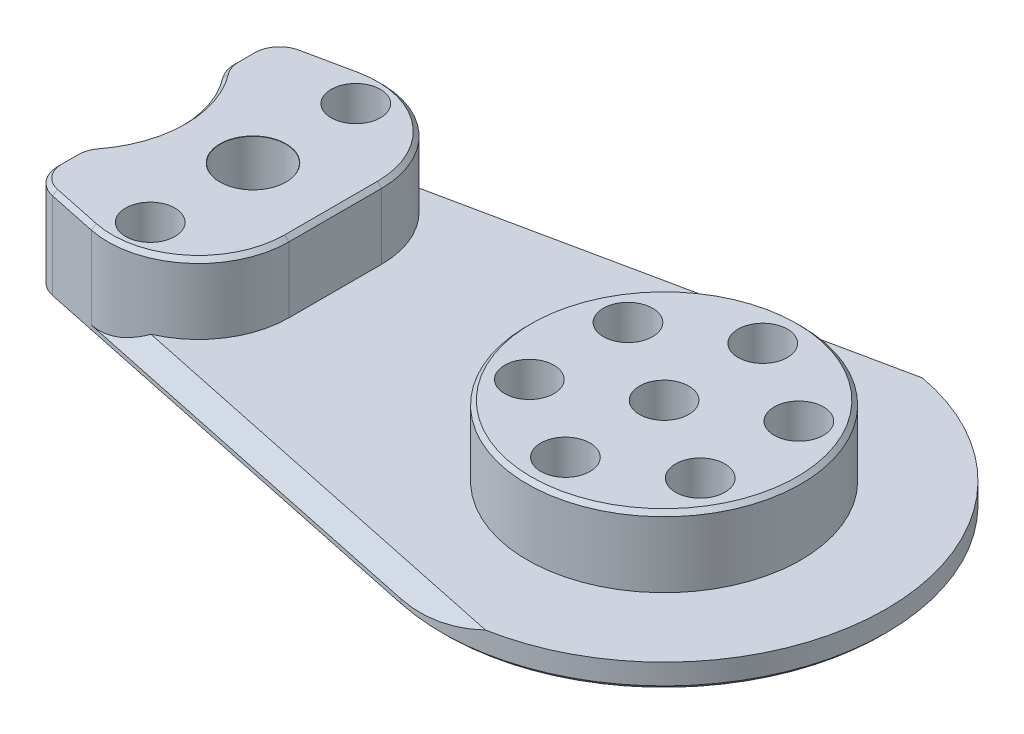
ISO-10303-21;
HEADER;
FILE_DESCRIPTION(('STEP AP214'),'2;1');
FILE_NAME('part.step','',(''),(''),'','','');
FILE_SCHEMA(('AUTOMOTIVE_DESIGN { 1 0 10303 214 1 1 1 1 }'));
ENDSEC;
DATA;
#1=APPLICATION_CONTEXT('core data for automotive mechanical design processes');
#2=APPLICATION_PROTOCOL_DEFINITION('international standard','automotive_design',2000,#1);
#3=PRODUCT_CONTEXT('',#1,'mechanical');
#4=PRODUCT('Part','Part','',(#3));
#5=PRODUCT_RELATED_PRODUCT_CATEGORY('part','',(#4));
#6=PRODUCT_DEFINITION_FORMATION('','',#4);
#7=PRODUCT_DEFINITION_CONTEXT('part definition',#1,'design');
#8=PRODUCT_DEFINITION('design','',#6,#7);
#9=PRODUCT_DEFINITION_SHAPE('','',#8);
#10=(LENGTH_UNIT() NAMED_UNIT(*) SI_UNIT(.MILLI.,.METRE.));
#11=(NAMED_UNIT(*) PLANE_ANGLE_UNIT() SI_UNIT($,.RADIAN.));
#12=(NAMED_UNIT(*) SI_UNIT($,.STERADIAN.) SOLID_ANGLE_UNIT());
#13=UNCERTAINTY_MEASURE_WITH_UNIT(LENGTH_MEASURE(1.E-05),#10,'distance_accuracy_value','');
#14=(GEOMETRIC_REPRESENTATION_CONTEXT(3) GLOBAL_UNCERTAINTY_ASSIGNED_CONTEXT((#13)) GLOBAL_UNIT_ASSIGNED_CONTEXT((#10,
#11,#12)) REPRESENTATION_CONTEXT('',''));
#15=CARTESIAN_POINT('',(0.,0.,0.));
#16=DIRECTION('',(0.,0.,1.));
#17=DIRECTION('',(1.,0.,0.));
#18=AXIS2_PLACEMENT_3D('',#15,#16,#17);
#19=CARTESIAN_POINT('',(0.,-11.5,0.));
#20=DIRECTION('',(0.,-1.,0.));
#21=DIRECTION('',(0.,0.,-1.));
#22=AXIS2_PLACEMENT_3D('',#19,#20,#21);
#23=PLANE('',#22);
#24=DIRECTION('',(0.978671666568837,0.,-0.205430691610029));
#25=VECTOR('',#24,1.);
#26=CARTESIAN_POINT('',(-5.44389320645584,-11.5,-25.9347033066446));
#27=LINE('',#26,#25);
#28=CARTESIAN_POINT('',(-59.1162920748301,-11.5,-14.6684549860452));
#29=VERTEX_POINT('',#28);
#30=CARTESIAN_POINT('',(-51.0169167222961,-11.5,-16.3685760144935));
#31=VERTEX_POINT('',#30);
#32=EDGE_CURVE('E660',#29,#31,#27,.T.);
#33=ORIENTED_EDGE('',*,*,#32,.T.);
#34=CARTESIAN_POINT('',(-50.,-11.5,-12.5));
#35=DIRECTION('',(0.,-1.,0.));
#36=DIRECTION('',(0.,0.,-1.));
#37=AXIS2_PLACEMENT_3D('',#34,#35,#36);
#38=CIRCLE('',#37,4.00000000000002);
#39=CARTESIAN_POINT('',(-51.9364916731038,-11.5,-9.));
#40=VERTEX_POINT('',#39);
#41=EDGE_CURVE('E822',#31,#40,#38,.F.);
#42=ORIENTED_EDGE('',*,*,#41,.T.);
#43=DIRECTION('',(-1.,0.,0.));
#44=VECTOR('',#43,1.);
#45=CARTESIAN_POINT('',(0.,-11.5,-9.00000000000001));
#46=LINE('',#45,#44);
#47=CARTESIAN_POINT('',(-59.,-11.5,-9.));
#48=VERTEX_POINT('',#47);
#49=EDGE_CURVE('E636',#40,#48,#46,.T.);
#50=ORIENTED_EDGE('',*,*,#49,.T.);
#51=CARTESIAN_POINT('',(-59.,-11.5,-11.5));
#52=DIRECTION('',(0.,-1.,0.));
#53=DIRECTION('',(0.,0.,-1.));
#54=AXIS2_PLACEMENT_3D('',#51,#52,#53);
#55=CIRCLE('',#54,2.5);
#56=CARTESIAN_POINT('',(-61.5,-11.5,-11.5));
#57=VERTEX_POINT('',#56);
#58=EDGE_CURVE('E645',#48,#57,#55,.T.);
#59=ORIENTED_EDGE('',*,*,#58,.T.);
#60=DIRECTION('',(0.,0.,-1.));
#61=VECTOR('',#60,1.);
#62=CARTESIAN_POINT('',(-61.5,-11.5,0.));
#63=LINE('',#62,#61);
#64=CARTESIAN_POINT('',(-61.5,-11.5,-11.7324399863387));
#65=VERTEX_POINT('',#64);
#66=EDGE_CURVE('E646',#57,#65,#63,.T.);
#67=ORIENTED_EDGE('',*,*,#66,.T.);
#68=CARTESIAN_POINT('',(-58.5,-11.5,-11.7324399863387));
#69=DIRECTION('',(0.,-1.,0.));
#70=DIRECTION('',(0.,0.,-1.));
#71=AXIS2_PLACEMENT_3D('',#68,#69,#70);
#72=CIRCLE('',#71,3.);
#73=EDGE_CURVE('E649',#65,#29,#72,.T.);
#74=ORIENTED_EDGE('',*,*,#73,.T.);
#75=EDGE_LOOP('',(#33,#42,#50,#59,#67,#74));
#76=FACE_BOUND('',#75,.T.);
#77=ADVANCED_FACE('F46',(#76),#23,.T.);
#78=CARTESIAN_POINT('',(-10.3923048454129,-11.5,-5.99999999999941));
#79=DIRECTION('',(0.,-1.,0.));
#80=DIRECTION('',(0.,0.,-1.));
#81=AXIS2_PLACEMENT_3D('',#78,#79,#80);
#82=CIRCLE('',#81,4.00000000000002);
#83=CARTESIAN_POINT('',(-10.3923048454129,-11.5,-9.99999999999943));
#84=VERTEX_POINT('',#83);
#85=EDGE_CURVE('E824',#84,#84,#82,.F.);
#86=ORIENTED_EDGE('',*,*,#85,.T.);
#87=EDGE_LOOP('',(#86));
#88=FACE_BOUND('',#87,.T.);
#89=DIRECTION('',(0.866025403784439,0.,-0.5));
#90=VECTOR('',#89,1.);
#91=CARTESIAN_POINT('',(2.91302811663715,-11.5,5.04551270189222));
#92=LINE('',#91,#90);
#93=CARTESIAN_POINT('',(0.,-11.5,6.72735026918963));
#94=VERTEX_POINT('',#93);
#95=CARTESIAN_POINT('',(5.8260562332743,-11.5,3.36367513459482));
#96=VERTEX_POINT('',#95);
#97=EDGE_CURVE('E728',#94,#96,#92,.T.);
#98=ORIENTED_EDGE('',*,*,#97,.T.);
#99=DIRECTION('',(0.,0.,-1.));
#100=VECTOR('',#99,1.);
#101=CARTESIAN_POINT('',(5.8260562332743,-11.5,0.));
#102=LINE('',#101,#100);
#103=CARTESIAN_POINT('',(5.8260562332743,-11.5,-3.36367513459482));
#104=VERTEX_POINT('',#103);
#105=EDGE_CURVE('E732',#96,#104,#102,.T.);
#106=ORIENTED_EDGE('',*,*,#105,.T.);
#107=DIRECTION('',(-0.866025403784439,0.,-0.5));
#108=VECTOR('',#107,1.);
#109=CARTESIAN_POINT('',(2.91302811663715,-11.5,-5.04551270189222));
#110=LINE('',#109,#108);
#111=CARTESIAN_POINT('',(0.,-11.5,-6.72735026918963));
#112=VERTEX_POINT('',#111);
#113=EDGE_CURVE('E688',#104,#112,#110,.T.);
#114=ORIENTED_EDGE('',*,*,#113,.T.);
#115=DIRECTION('',(-0.866025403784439,0.,0.5));
#116=VECTOR('',#115,1.);
#117=CARTESIAN_POINT('',(-2.91302811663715,-11.5,-5.04551270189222));
#118=LINE('',#117,#116);
#119=CARTESIAN_POINT('',(-5.8260562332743,-11.5,-3.36367513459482));
#120=VERTEX_POINT('',#119);
#121=EDGE_CURVE('E723',#112,#120,#118,.T.);
#122=ORIENTED_EDGE('',*,*,#121,.T.);
#123=DIRECTION('',(0.,0.,1.));
#124=VECTOR('',#123,1.);
#125=CARTESIAN_POINT('',(-5.8260562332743,-11.5,0.));
#126=LINE('',#125,#124);
#127=CARTESIAN_POINT('',(-5.8260562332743,-11.5,3.36367513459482));
#128=VERTEX_POINT('',#127);
#129=EDGE_CURVE('E724',#120,#128,#126,.T.);
#130=ORIENTED_EDGE('',*,*,#129,.T.);
#131=DIRECTION('',(0.866025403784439,0.,0.5));
#132=VECTOR('',#131,1.);
#133=CARTESIAN_POINT('',(-2.91302811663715,-11.5,5.04551270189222));
#134=LINE('',#133,#132);
#135=EDGE_CURVE('E730',#128,#94,#134,.T.);
#136=ORIENTED_EDGE('',*,*,#135,.T.);
#137=EDGE_LOOP('',(#98,#106,#114,#122,#130,#136));
#138=FACE_BOUND('',#137,.T.);
#139=CARTESIAN_POINT('',(-10.3923048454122,-11.5,6.00000000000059));
#140=DIRECTION('',(0.,-1.,0.));
#141=DIRECTION('',(0.,0.,-1.));
#142=AXIS2_PLACEMENT_3D('',#139,#140,#141);
#143=CIRCLE('',#142,4.00000000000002);
#144=CARTESIAN_POINT('',(-10.3923048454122,-11.5,2.00000000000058));
#145=VERTEX_POINT('',#144);
#146=EDGE_CURVE('E789',#145,#145,#143,.F.);
#147=ORIENTED_EDGE('',*,*,#146,.T.);
#148=EDGE_LOOP('',(#147));
#149=FACE_BOUND('',#148,.T.);
#150=CARTESIAN_POINT('',(1.35983332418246E-12,-11.5,12.));
#151=DIRECTION('',(0.,-1.,0.));
#152=DIRECTION('',(0.,0.,-1.));
#153=AXIS2_PLACEMENT_3D('',#150,#151,#152);
#154=CIRCLE('',#153,4.00000000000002);
#155=CARTESIAN_POINT('',(1.35983332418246E-12,-11.5,7.99999999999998));
#156=VERTEX_POINT('',#155);
#157=EDGE_CURVE('E805',#156,#156,#154,.F.);
#158=ORIENTED_EDGE('',*,*,#157,.T.);
#159=EDGE_LOOP('',(#158));
#160=FACE_BOUND('',#159,.T.);
#161=CARTESIAN_POINT('',(10.3923048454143,-11.5,5.99999999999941));
#162=DIRECTION('',(0.,-1.,0.));
#163=DIRECTION('',(0.,0.,-1.));
#164=AXIS2_PLACEMENT_3D('',#161,#162,#163);
#165=CIRCLE('',#164,4.00000000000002);
#166=CARTESIAN_POINT('',(10.3923048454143,-11.5,1.99999999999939));
#167=VERTEX_POINT('',#166);
#168=EDGE_CURVE('E804',#167,#167,#165,.F.);
#169=ORIENTED_EDGE('',*,*,#168,.T.);
#170=EDGE_LOOP('',(#169));
#171=FACE_BOUND('',#170,.T.);
#172=CARTESIAN_POINT('',(10.3923048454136,-11.5,-6.00000000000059));
#173=DIRECTION('',(0.,-1.,0.));
#174=DIRECTION('',(0.,0.,-1.));
#175=AXIS2_PLACEMENT_3D('',#172,#173,#174);
#176=CIRCLE('',#175,4.00000000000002);
#177=CARTESIAN_POINT('',(10.3923048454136,-11.5,-10.0000000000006));
#178=VERTEX_POINT('',#177);
#179=EDGE_CURVE('E809',#178,#178,#176,.F.);
#180=ORIENTED_EDGE('',*,*,#179,.T.);
#181=EDGE_LOOP('',(#180));
#182=FACE_BOUND('',#181,.T.);
#183=CARTESIAN_POINT('',(0.,-11.5,-12.));
#184=DIRECTION('',(0.,-1.,0.));
#185=DIRECTION('',(0.,0.,-1.));
#186=AXIS2_PLACEMENT_3D('',#183,#184,#185);
#187=CIRCLE('',#186,4.00000000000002);
#188=CARTESIAN_POINT('',(0.,-11.5,-16.));
#189=VERTEX_POINT('',#188);
#190=EDGE_CURVE('E811',#189,#189,#187,.F.);
#191=ORIENTED_EDGE('',*,*,#190,.T.);
#192=EDGE_LOOP('',(#191));
#193=FACE_BOUND('',#192,.T.);
#194=CARTESIAN_POINT('',(-50.,-11.5,0.));
#195=DIRECTION('',(0.,-1.,0.));
#196=DIRECTION('',(0.,0.,-1.));
#197=AXIS2_PLACEMENT_3D('',#194,#195,#196);
#198=CIRCLE('',#197,9.);
#199=CARTESIAN_POINT('',(-48.3636931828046,-11.5,8.85));
#200=VERTEX_POINT('',#199);
#201=CARTESIAN_POINT('',(-48.3636931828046,-11.5,-8.84999999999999));
#202=VERTEX_POINT('',#201);
#203=EDGE_CURVE('E634',#200,#202,#198,.F.);
#204=ORIENTED_EDGE('',*,*,#203,.T.);
#205=CARTESIAN_POINT('',(-50.,-11.5,-12.5));
#206=DIRECTION('',(0.,-1.,0.));
#207=DIRECTION('',(0.,0.,-1.));
#208=AXIS2_PLACEMENT_3D('',#205,#206,#207);
#209=CIRCLE('',#208,4.00000000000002);
#210=CARTESIAN_POINT('',(-50.6244628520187,-11.5,-16.4509550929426));
#211=VERTEX_POINT('',#210);
#212=EDGE_CURVE('E820',#202,#211,#209,.F.);
#213=ORIENTED_EDGE('',*,*,#212,.T.);
#214=CARTESIAN_POINT('',(-5.44389320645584,-11.5,-25.9347033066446));
#215=VERTEX_POINT('',#214);
#216=EDGE_CURVE('E657',#211,#215,#27,.T.);
#217=ORIENTED_EDGE('',*,*,#216,.T.);
#218=CARTESIAN_POINT('',(0.,-11.5,0.));
#219=DIRECTION('',(0.,-1.,0.));
#220=DIRECTION('',(0.,0.,-1.));
#221=AXIS2_PLACEMENT_3D('',#218,#219,#220);
#222=CIRCLE('',#221,26.4999020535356);
#223=CARTESIAN_POINT('',(-5.44389320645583,-11.5,25.9347033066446));
#224=VERTEX_POINT('',#223);
#225=EDGE_CURVE('E658',#215,#224,#222,.T.);
#226=ORIENTED_EDGE('',*,*,#225,.T.);
#227=DIRECTION('',(-0.978671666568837,0.,-0.205430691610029));
#228=VECTOR('',#227,1.);
#229=CARTESIAN_POINT('',(-5.44389320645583,-11.5,25.9347033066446));
#230=LINE('',#229,#228);
#231=CARTESIAN_POINT('',(-50.6244628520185,-11.5,16.4509550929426));
#232=VERTEX_POINT('',#231);
#233=EDGE_CURVE('E652',#224,#232,#230,.T.);
#234=ORIENTED_EDGE('',*,*,#233,.T.);
#235=CARTESIAN_POINT('',(-50.,-11.5,12.5));
#236=DIRECTION('',(0.,-1.,0.));
#237=DIRECTION('',(0.,0.,-1.));
#238=AXIS2_PLACEMENT_3D('',#235,#236,#237);
#239=CIRCLE('',#238,4.00000000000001);
#240=EDGE_CURVE('E818',#232,#200,#239,.F.);
#241=ORIENTED_EDGE('',*,*,#240,.T.);
#242=EDGE_LOOP('',(#204,#213,#217,#226,#234,#241));
#243=FACE_BOUND('',#242,.T.);
#244=ADVANCED_FACE('F966',(#88,#138,#149,#160,#171,#182,#193,#243),#23,.T.);
#245=DIRECTION('',(1.,0.,0.));
#246=VECTOR('',#245,1.);
#247=CARTESIAN_POINT('',(0.,-11.5,8.99999999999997));
#248=LINE('',#247,#246);
#249=CARTESIAN_POINT('',(-59.,-11.5,9.));
#250=VERTEX_POINT('',#249);
#251=CARTESIAN_POINT('',(-51.9364916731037,-11.5,9.));
#252=VERTEX_POINT('',#251);
#253=EDGE_CURVE('E632',#250,#252,#248,.T.);
#254=ORIENTED_EDGE('',*,*,#253,.T.);
#255=CARTESIAN_POINT('',(-50.,-11.5,12.5));
#256=DIRECTION('',(0.,-1.,0.));
#257=DIRECTION('',(0.,0.,-1.));
#258=AXIS2_PLACEMENT_3D('',#255,#256,#257);
#259=CIRCLE('',#258,4.00000000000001);
#260=CARTESIAN_POINT('',(-51.0169167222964,-11.5,16.3685760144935));
#261=VERTEX_POINT('',#260);
#262=EDGE_CURVE('E813',#252,#261,#259,.F.);
#263=ORIENTED_EDGE('',*,*,#262,.T.);
#264=CARTESIAN_POINT('',(-59.1162920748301,-11.5,14.6684549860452));
#265=VERTEX_POINT('',#264);
#266=EDGE_CURVE('E655',#261,#265,#230,.T.);
#267=ORIENTED_EDGE('',*,*,#266,.T.);
#268=CARTESIAN_POINT('',(-58.5,-11.5,11.7324399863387));
#269=DIRECTION('',(0.,-1.,0.));
#270=DIRECTION('',(0.,0.,-1.));
#271=AXIS2_PLACEMENT_3D('',#268,#269,#270);
#272=CIRCLE('',#271,3.);
#273=CARTESIAN_POINT('',(-61.5,-11.5,11.7324399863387));
#274=VERTEX_POINT('',#273);
#275=EDGE_CURVE('E648',#265,#274,#272,.T.);
#276=ORIENTED_EDGE('',*,*,#275,.T.);
#277=DIRECTION('',(0.,0.,-1.));
#278=VECTOR('',#277,1.);
#279=CARTESIAN_POINT('',(-61.5,-11.5,0.));
#280=LINE('',#279,#278);
#281=CARTESIAN_POINT('',(-61.5,-11.5,11.5));
#282=VERTEX_POINT('',#281);
#283=EDGE_CURVE('E642',#274,#282,#280,.T.);
#284=ORIENTED_EDGE('',*,*,#283,.T.);
#285=CARTESIAN_POINT('',(-59.,-11.5,11.5));
#286=DIRECTION('',(0.,-1.,0.));
#287=DIRECTION('',(0.,0.,-1.));
#288=AXIS2_PLACEMENT_3D('',#285,#286,#287);
#289=CIRCLE('',#288,2.5);
#290=EDGE_CURVE('E637',#282,#250,#289,.T.);
#291=ORIENTED_EDGE('',*,*,#290,.T.);
#292=EDGE_LOOP('',(#254,#263,#267,#276,#284,#291));
#293=FACE_BOUND('',#292,.T.);
#294=ADVANCED_FACE('F973',(#293),#23,.T.);
#295=CARTESIAN_POINT('',(-58.5,-11.5,9.73190628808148));
#296=DIRECTION('',(0.,1.,0.));
#297=DIRECTION('',(0.,0.,1.));
#298=AXIS2_PLACEMENT_3D('',#295,#296,#297);
#299=CYLINDRICAL_SURFACE('',#298,3.5);
#300=DIRECTION('',(0.,1.,0.));
#301=VECTOR('',#300,1.);
#302=CARTESIAN_POINT('',(-61.278125,-11.5,7.60305178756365));
#303=LINE('',#302,#301);
#304=CARTESIAN_POINT('',(-61.278125,-7.49999999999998,7.60305178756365));
#305=VERTEX_POINT('',#304);
#306=CARTESIAN_POINT('',(-61.278125,-0.500000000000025,7.60305178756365));
#307=VERTEX_POINT('',#306);
#308=EDGE_CURVE('E471',#305,#307,#303,.T.);
#309=ORIENTED_EDGE('',*,*,#308,.F.);
#310=CARTESIAN_POINT('',(-58.5,-7.49999999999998,9.73190628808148));
#311=DIRECTION('',(0.,1.,0.));
#312=DIRECTION('',(0.,0.,1.));
#313=AXIS2_PLACEMENT_3D('',#310,#311,#312);
#314=CIRCLE('',#313,3.5);
#315=CARTESIAN_POINT('',(-62.,-7.49999999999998,9.73190628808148));
#316=VERTEX_POINT('',#315);
#317=EDGE_CURVE('E779',#305,#316,#314,.T.);
#318=ORIENTED_EDGE('',*,*,#317,.T.);
#319=DIRECTION('',(0.,-1.,0.));
#320=VECTOR('',#319,1.);
#321=CARTESIAN_POINT('',(-62.,-11.5,9.73190628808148));
#322=LINE('',#321,#320);
#323=CARTESIAN_POINT('',(-62.,-0.500000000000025,9.73190628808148));
#324=VERTEX_POINT('',#323);
#325=EDGE_CURVE('E480',#324,#316,#322,.T.);
#326=ORIENTED_EDGE('',*,*,#325,.F.);
#327=CARTESIAN_POINT('',(-58.5,-0.500000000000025,9.73190628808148));
#328=DIRECTION('',(0.,-1.,0.));
#329=DIRECTION('',(0.,0.,-1.));
#330=AXIS2_PLACEMENT_3D('',#327,#328,#329);
#331=CIRCLE('',#330,3.5);
#332=EDGE_CURVE('E527',#324,#307,#331,.T.);
#333=ORIENTED_EDGE('',*,*,#332,.T.);
#334=EDGE_LOOP('',(#309,#318,#326,#333));
#335=FACE_BOUND('',#334,.T.);
#336=ADVANCED_FACE('F982',(#335),#299,.T.);
#337=CARTESIAN_POINT('',(-58.5,-11.5,-9.73190628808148));
#338=DIRECTION('',(0.,1.,0.));
#339=DIRECTION('',(0.,0.,1.));
#340=AXIS2_PLACEMENT_3D('',#337,#338,#339);
#341=CYLINDRICAL_SURFACE('',#340,3.5);
#342=DIRECTION('',(0.,-1.,0.));
#343=VECTOR('',#342,1.);
#344=CARTESIAN_POINT('',(-62.,0.,-9.73190628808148));
#345=LINE('',#344,#343);
#346=CARTESIAN_POINT('',(-62.,-7.49999999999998,-9.73190628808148));
#347=VERTEX_POINT('',#346);
#348=CARTESIAN_POINT('',(-62.,-0.500000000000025,-9.73190628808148));
#349=VERTEX_POINT('',#348);
#350=EDGE_CURVE('E479',#347,#349,#345,.F.);
#351=ORIENTED_EDGE('',*,*,#350,.F.);
#352=CARTESIAN_POINT('',(-58.5,-7.49999999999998,-9.73190628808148));
#353=DIRECTION('',(0.,1.,0.));
#354=DIRECTION('',(0.,0.,1.));
#355=AXIS2_PLACEMENT_3D('',#352,#353,#354);
#356=CIRCLE('',#355,3.5);
#357=CARTESIAN_POINT('',(-61.278125,-7.49999999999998,-7.60305178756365));
#358=VERTEX_POINT('',#357);
#359=EDGE_CURVE('E777',#347,#358,#356,.T.);
#360=ORIENTED_EDGE('',*,*,#359,.T.);
#361=DIRECTION('',(0.,1.,0.));
#362=VECTOR('',#361,1.);
#363=CARTESIAN_POINT('',(-61.278125,-11.5,-7.60305178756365));
#364=LINE('',#363,#362);
#365=CARTESIAN_POINT('',(-61.278125,-0.500000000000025,-7.60305178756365));
#366=VERTEX_POINT('',#365);
#367=EDGE_CURVE('E475',#366,#358,#364,.F.);
#368=ORIENTED_EDGE('',*,*,#367,.F.);
#369=CARTESIAN_POINT('',(-58.5,-0.500000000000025,-9.73190628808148));
#370=DIRECTION('',(0.,-1.,0.));
#371=DIRECTION('',(0.,0.,-1.));
#372=AXIS2_PLACEMENT_3D('',#369,#370,#371);
#373=CIRCLE('',#372,3.5);
#374=EDGE_CURVE('E521',#366,#349,#373,.T.);
#375=ORIENTED_EDGE('',*,*,#374,.T.);
#376=EDGE_LOOP('',(#351,#360,#368,#375));
#377=FACE_BOUND('',#376,.T.);
#378=ADVANCED_FACE('F990',(#377),#341,.T.);
#379=CARTESIAN_POINT('',(0.,0.,0.));
#380=DIRECTION('',(0.,-1.,0.));
#381=DIRECTION('',(0.,0.,-1.));
#382=AXIS2_PLACEMENT_3D('',#379,#380,#381);
#383=PLANE('',#382);
#384=CARTESIAN_POINT('',(-58.5,0.,-9.73190628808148));
#385=DIRECTION('',(0.,-1.,0.));
#386=DIRECTION('',(0.,0.,-1.));
#387=AXIS2_PLACEMENT_3D('',#384,#385,#386);
#388=CIRCLE('',#387,2.99999999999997);
#389=CARTESIAN_POINT('',(-61.5,0.,-9.73190628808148));
#390=VERTEX_POINT('',#389);
#391=CARTESIAN_POINT('',(-60.88125,0.,-7.90717385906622));
#392=VERTEX_POINT('',#391);
#393=EDGE_CURVE('E516',#390,#392,#388,.F.);
#394=ORIENTED_EDGE('',*,*,#393,.T.);
#395=CARTESIAN_POINT('',(-71.2,0.,0.));
#396=DIRECTION('',(0.,-1.,0.));
#397=DIRECTION('',(0.,0.,-1.));
#398=AXIS2_PLACEMENT_3D('',#395,#396,#397);
#399=CIRCLE('',#398,13.);
#400=CARTESIAN_POINT('',(-60.88125,0.,7.90717385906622));
#401=VERTEX_POINT('',#400);
#402=EDGE_CURVE('E525',#392,#401,#399,.T.);
#403=ORIENTED_EDGE('',*,*,#402,.T.);
#404=CARTESIAN_POINT('',(-58.5,0.,9.73190628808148));
#405=DIRECTION('',(0.,-1.,0.));
#406=DIRECTION('',(0.,0.,-1.));
#407=AXIS2_PLACEMENT_3D('',#404,#405,#406);
#408=CIRCLE('',#407,2.99999999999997);
#409=CARTESIAN_POINT('',(-61.5,0.,9.73190628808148));
#410=VERTEX_POINT('',#409);
#411=EDGE_CURVE('E517',#401,#410,#408,.F.);
#412=ORIENTED_EDGE('',*,*,#411,.T.);
#413=DIRECTION('',(0.,0.,1.));
#414=VECTOR('',#413,1.);
#415=CARTESIAN_POINT('',(-61.5,0.,11.7324399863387));
#416=LINE('',#415,#414);
#417=CARTESIAN_POINT('',(-61.5,0.,11.7324399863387));
#418=VERTEX_POINT('',#417);
#419=EDGE_CURVE('E513',#410,#418,#416,.T.);
#420=ORIENTED_EDGE('',*,*,#419,.T.);
#421=CARTESIAN_POINT('',(-58.5,0.,11.7324399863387));
#422=DIRECTION('',(0.,-1.,0.));
#423=DIRECTION('',(0.,0.,-1.));
#424=AXIS2_PLACEMENT_3D('',#421,#422,#423);
#425=CIRCLE('',#424,2.99999999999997);
#426=CARTESIAN_POINT('',(-59.1162920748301,0.,14.6684549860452));
#427=VERTEX_POINT('',#426);
#428=EDGE_CURVE('E508',#418,#427,#425,.F.);
#429=ORIENTED_EDGE('',*,*,#428,.T.);
#430=DIRECTION('',(0.978671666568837,0.,0.205430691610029));
#431=VECTOR('',#430,1.);
#432=CARTESIAN_POINT('',(-53.1570222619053,0.,15.9193514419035));
#433=LINE('',#432,#431);
#434=CARTESIAN_POINT('',(-53.1570222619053,0.,15.9193514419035));
#435=VERTEX_POINT('',#434);
#436=EDGE_CURVE('E507',#427,#435,#433,.T.);
#437=ORIENTED_EDGE('',*,*,#436,.T.);
#438=CARTESIAN_POINT('',(-51.,0.,5.64329894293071));
#439=DIRECTION('',(0.,-1.,0.));
#440=DIRECTION('',(0.,0.,-1.));
#441=AXIS2_PLACEMENT_3D('',#438,#439,#440);
#442=CIRCLE('',#441,10.5);
#443=CARTESIAN_POINT('',(-40.5,0.,5.64329894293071));
#444=VERTEX_POINT('',#443);
#445=EDGE_CURVE('E499',#435,#444,#442,.F.);
#446=ORIENTED_EDGE('',*,*,#445,.T.);
#447=DIRECTION('',(0.,0.,-1.));
#448=VECTOR('',#447,1.);
#449=CARTESIAN_POINT('',(-40.5,0.,-5.6432989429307));
#450=LINE('',#449,#448);
#451=CARTESIAN_POINT('',(-40.5,0.,-5.6432989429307));
#452=VERTEX_POINT('',#451);
#453=EDGE_CURVE('E505',#444,#452,#450,.T.);
#454=ORIENTED_EDGE('',*,*,#453,.T.);
#455=CARTESIAN_POINT('',(-51.,0.,-5.6432989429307));
#456=DIRECTION('',(0.,-1.,0.));
#457=DIRECTION('',(0.,0.,-1.));
#458=AXIS2_PLACEMENT_3D('',#455,#456,#457);
#459=CIRCLE('',#458,10.5);
#460=CARTESIAN_POINT('',(-53.1570222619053,0.,-15.9193514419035));
#461=VERTEX_POINT('',#460);
#462=EDGE_CURVE('E503',#452,#461,#459,.F.);
#463=ORIENTED_EDGE('',*,*,#462,.T.);
#464=DIRECTION('',(-0.978671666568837,0.,0.205430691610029));
#465=VECTOR('',#464,1.);
#466=CARTESIAN_POINT('',(-59.1162920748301,0.,-14.6684549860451));
#467=LINE('',#466,#465);
#468=CARTESIAN_POINT('',(-59.1162920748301,0.,-14.6684549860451));
#469=VERTEX_POINT('',#468);
#470=EDGE_CURVE('E509',#461,#469,#467,.T.);
#471=ORIENTED_EDGE('',*,*,#470,.T.);
#472=CARTESIAN_POINT('',(-58.5,0.,-11.7324399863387));
#473=DIRECTION('',(0.,-1.,0.));
#474=DIRECTION('',(0.,0.,-1.));
#475=AXIS2_PLACEMENT_3D('',#472,#473,#474);
#476=CIRCLE('',#475,2.99999999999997);
#477=CARTESIAN_POINT('',(-61.5,0.,-11.7324399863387));
#478=VERTEX_POINT('',#477);
#479=EDGE_CURVE('E515',#469,#478,#476,.F.);
#480=ORIENTED_EDGE('',*,*,#479,.T.);
#481=DIRECTION('',(0.,0.,1.));
#482=VECTOR('',#481,1.);
#483=CARTESIAN_POINT('',(-61.5,0.,-9.73190628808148));
#484=LINE('',#483,#482);
#485=EDGE_CURVE('E518',#478,#390,#484,.T.);
#486=ORIENTED_EDGE('',*,*,#485,.T.);
#487=EDGE_LOOP('',(#394,#403,#412,#420,#429,#437,#446,#454,#463,#471,#480,#486));
#488=FACE_BOUND('',#487,.T.);
#489=CARTESIAN_POINT('',(-50.,0.,12.5));
#490=DIRECTION('',(0.,1.,0.));
#491=DIRECTION('',(0.,0.,1.));
#492=AXIS2_PLACEMENT_3D('',#489,#490,#491);
#493=CIRCLE('',#492,3.);
#494=CARTESIAN_POINT('',(-50.,0.,15.5));
#495=VERTEX_POINT('',#494);
#496=EDGE_CURVE('E459',#495,#495,#493,.T.);
#497=ORIENTED_EDGE('',*,*,#496,.F.);
#498=EDGE_LOOP('',(#497));
#499=FACE_BOUND('',#498,.T.);
#500=CARTESIAN_POINT('',(-50.,0.,-12.5));
#501=DIRECTION('',(0.,1.,0.));
#502=DIRECTION('',(0.,0.,1.));
#503=AXIS2_PLACEMENT_3D('',#500,#501,#502);
#504=CIRCLE('',#503,3.);
#505=CARTESIAN_POINT('',(-50.,0.,-9.5));
#506=VERTEX_POINT('',#505);
#507=EDGE_CURVE('E457',#506,#506,#504,.T.);
#508=ORIENTED_EDGE('',*,*,#507,.F.);
#509=EDGE_LOOP('',(#508));
#510=FACE_BOUND('',#509,.T.);
#511=CARTESIAN_POINT('',(-50.,0.,0.));
#512=DIRECTION('',(0.,1.,0.));
#513=DIRECTION('',(0.,0.,1.));
#514=AXIS2_PLACEMENT_3D('',#511,#512,#513);
#515=CIRCLE('',#514,4.025);
#516=CARTESIAN_POINT('',(-50.,0.,4.025));
#517=VERTEX_POINT('',#516);
#518=EDGE_CURVE('E427',#517,#517,#515,.T.);
#519=ORIENTED_EDGE('',*,*,#518,.F.);
#520=EDGE_LOOP('',(#519));
#521=FACE_BOUND('',#520,.T.);
#522=ADVANCED_FACE('F1232',(#488,#499,#510,#521),#383,.F.);
#523=CARTESIAN_POINT('',(-62.,-25.,-14.574039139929));
#524=DIRECTION('',(-1.,0.,0.));
#525=DIRECTION('',(0.,0.,1.));
#526=AXIS2_PLACEMENT_3D('',#523,#524,#525);
#527=PLANE('',#526);
#528=ORIENTED_EDGE('',*,*,#325,.T.);
#529=DIRECTION('',(0.,0.,1.));
#530=VECTOR('',#529,1.);
#531=CARTESIAN_POINT('',(-62.,-7.49999999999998,11.5));
#532=LINE('',#531,#530);
#533=CARTESIAN_POINT('',(-62.,-7.49999999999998,11.5));
#534=VERTEX_POINT('',#533);
#535=EDGE_CURVE('E771',#316,#534,#532,.T.);
#536=ORIENTED_EDGE('',*,*,#535,.T.);
#537=DIRECTION('',(0.,-1.,0.));
#538=VECTOR('',#537,1.);
#539=CARTESIAN_POINT('',(-62.,-25.,11.5));
#540=LINE('',#539,#538);
#541=CARTESIAN_POINT('',(-62.,-11.,11.5));
#542=VERTEX_POINT('',#541);
#543=EDGE_CURVE('E618',#534,#542,#540,.T.);
#544=ORIENTED_EDGE('',*,*,#543,.T.);
#545=DIRECTION('',(0.,0.,1.));
#546=VECTOR('',#545,1.);
#547=CARTESIAN_POINT('',(-62.,-11.,-14.574039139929));
#548=LINE('',#547,#546);
#549=CARTESIAN_POINT('',(-62.,-11.,11.7324399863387));
#550=VERTEX_POINT('',#549);
#551=EDGE_CURVE('E676',#542,#550,#548,.T.);
#552=ORIENTED_EDGE('',*,*,#551,.T.);
#553=DIRECTION('',(0.,1.,0.));
#554=VECTOR('',#553,1.);
#555=CARTESIAN_POINT('',(-62.,-25.,11.7324399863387));
#556=LINE('',#555,#554);
#557=CARTESIAN_POINT('',(-62.,-0.500000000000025,11.7324399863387));
#558=VERTEX_POINT('',#557);
#559=EDGE_CURVE('E465',#550,#558,#556,.T.);
#560=ORIENTED_EDGE('',*,*,#559,.T.);
#561=DIRECTION('',(0.,0.,-1.));
#562=VECTOR('',#561,1.);
#563=CARTESIAN_POINT('',(-62.,-0.500000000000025,9.73190628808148));
#564=LINE('',#563,#562);
#565=EDGE_CURVE('E531',#558,#324,#564,.T.);
#566=ORIENTED_EDGE('',*,*,#565,.T.);
#567=EDGE_LOOP('',(#528,#536,#544,#552,#560,#566));
#568=FACE_BOUND('',#567,.T.);
#569=ADVANCED_FACE('F1187',(#568),#527,.T.);
#570=CARTESIAN_POINT('',(0.,0.,0.));
#571=DIRECTION('',(0.,-1.,0.));
#572=DIRECTION('',(0.,0.,-1.));
#573=AXIS2_PLACEMENT_3D('',#570,#571,#572);
#574=CIRCLE('',#573,16.15);
#575=CARTESIAN_POINT('',(0.,0.,-16.15));
#576=VERTEX_POINT('',#575);
#577=EDGE_CURVE('E553',#576,#576,#574,.F.);
#578=ORIENTED_EDGE('',*,*,#577,.T.);
#579=EDGE_LOOP('',(#578));
#580=FACE_BOUND('',#579,.T.);
#581=CARTESIAN_POINT('',(0.,0.,-12.));
#582=DIRECTION('',(0.,1.,0.));
#583=DIRECTION('',(0.,0.,1.));
#584=AXIS2_PLACEMENT_3D('',#581,#582,#583);
#585=CIRCLE('',#584,3.);
#586=CARTESIAN_POINT('',(0.,0.,-9.));
#587=VERTEX_POINT('',#586);
#588=EDGE_CURVE('E433',#587,#587,#585,.T.);
#589=ORIENTED_EDGE('',*,*,#588,.F.);
#590=EDGE_LOOP('',(#589));
#591=FACE_BOUND('',#590,.T.);
#592=CARTESIAN_POINT('',(10.3923048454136,0.,-6.00000000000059));
#593=DIRECTION('',(0.,1.,0.));
#594=DIRECTION('',(0.,0.,1.));
#595=AXIS2_PLACEMENT_3D('',#592,#593,#594);
#596=CIRCLE('',#595,3.);
#597=CARTESIAN_POINT('',(10.3923048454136,0.,-3.00000000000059));
#598=VERTEX_POINT('',#597);
#599=EDGE_CURVE('E437',#598,#598,#596,.T.);
#600=ORIENTED_EDGE('',*,*,#599,.F.);
#601=EDGE_LOOP('',(#600));
#602=FACE_BOUND('',#601,.T.);
#603=CARTESIAN_POINT('',(10.3923048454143,0.,5.99999999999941));
#604=DIRECTION('',(0.,1.,0.));
#605=DIRECTION('',(0.,0.,1.));
#606=AXIS2_PLACEMENT_3D('',#603,#604,#605);
#607=CIRCLE('',#606,3.);
#608=CARTESIAN_POINT('',(10.3923048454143,0.,8.99999999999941));
#609=VERTEX_POINT('',#608);
#610=EDGE_CURVE('E443',#609,#609,#607,.T.);
#611=ORIENTED_EDGE('',*,*,#610,.F.);
#612=EDGE_LOOP('',(#611));
#613=FACE_BOUND('',#612,.T.);
#614=CARTESIAN_POINT('',(1.35983332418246E-12,0.,12.));
#615=DIRECTION('',(0.,1.,0.));
#616=DIRECTION('',(0.,0.,1.));
#617=AXIS2_PLACEMENT_3D('',#614,#615,#616);
#618=CIRCLE('',#617,3.);
#619=CARTESIAN_POINT('',(1.35983332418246E-12,0.,15.));
#620=VERTEX_POINT('',#619);
#621=EDGE_CURVE('E445',#620,#620,#618,.T.);
#622=ORIENTED_EDGE('',*,*,#621,.F.);
#623=EDGE_LOOP('',(#622));
#624=FACE_BOUND('',#623,.T.);
#625=CARTESIAN_POINT('',(-10.3923048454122,0.,6.00000000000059));
#626=DIRECTION('',(0.,1.,0.));
#627=DIRECTION('',(0.,0.,1.));
#628=AXIS2_PLACEMENT_3D('',#625,#626,#627);
#629=CIRCLE('',#628,3.);
#630=CARTESIAN_POINT('',(-10.3923048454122,0.,9.00000000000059));
#631=VERTEX_POINT('',#630);
#632=EDGE_CURVE('E450',#631,#631,#629,.T.);
#633=ORIENTED_EDGE('',*,*,#632,.F.);
#634=EDGE_LOOP('',(#633));
#635=FACE_BOUND('',#634,.T.);
#636=CARTESIAN_POINT('',(-10.3923048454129,0.,-5.99999999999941));
#637=DIRECTION('',(0.,1.,0.));
#638=DIRECTION('',(0.,0.,1.));
#639=AXIS2_PLACEMENT_3D('',#636,#637,#638);
#640=CIRCLE('',#639,3.);
#641=CARTESIAN_POINT('',(-10.3923048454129,0.,-2.99999999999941));
#642=VERTEX_POINT('',#641);
#643=EDGE_CURVE('E446',#642,#642,#640,.T.);
#644=ORIENTED_EDGE('',*,*,#643,.F.);
#645=EDGE_LOOP('',(#644));
#646=FACE_BOUND('',#645,.T.);
#647=CARTESIAN_POINT('',(6.79181874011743E-13,0.,0.));
#648=DIRECTION('',(0.,1.,0.));
#649=DIRECTION('',(0.,0.,1.));
#650=AXIS2_PLACEMENT_3D('',#647,#648,#649);
#651=CIRCLE('',#650,2.99999999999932);
#652=CARTESIAN_POINT('',(6.79181874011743E-13,0.,2.99999999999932));
#653=VERTEX_POINT('',#652);
#654=EDGE_CURVE('E452',#653,#653,#651,.T.);
#655=ORIENTED_EDGE('',*,*,#654,.F.);
#656=EDGE_LOOP('',(#655));
#657=FACE_BOUND('',#656,.T.);
#658=ADVANCED_FACE('F1238',(#580,#591,#602,#613,#624,#635,#646,#657),#383,.F.);
#659=CARTESIAN_POINT('',(-50.,0.,12.5));
#660=DIRECTION('',(0.,1.,0.));
#661=DIRECTION('',(0.,0.,1.));
#662=AXIS2_PLACEMENT_3D('',#659,#660,#661);
#663=CYLINDRICAL_SURFACE('',#662,3.);
#664=CARTESIAN_POINT('',(-50.,-10.5,12.5));
#665=DIRECTION('',(0.,-1.,0.));
#666=DIRECTION('',(0.,0.,-1.));
#667=AXIS2_PLACEMENT_3D('',#664,#665,#666);
#668=CIRCLE('',#667,3.);
#669=CARTESIAN_POINT('',(-50.,-10.5,9.50000000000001));
#670=VERTEX_POINT('',#669);
#671=EDGE_CURVE('E1003',#670,#670,#668,.T.);
#672=ORIENTED_EDGE('',*,*,#671,.T.);
#673=EDGE_LOOP('',(#672));
#674=FACE_BOUND('',#673,.T.);
#675=ORIENTED_EDGE('',*,*,#496,.T.);
#676=EDGE_LOOP('',(#675));
#677=FACE_BOUND('',#676,.T.);
#678=ADVANCED_FACE('F1227',(#674,#677),#663,.F.);
#679=CARTESIAN_POINT('',(-50.,0.,-12.5));
#680=DIRECTION('',(0.,1.,0.));
#681=DIRECTION('',(0.,0.,1.));
#682=AXIS2_PLACEMENT_3D('',#679,#680,#681);
#683=CYLINDRICAL_SURFACE('',#682,3.);
#684=CARTESIAN_POINT('',(-50.,-10.5,-12.5));
#685=DIRECTION('',(0.,-1.,0.));
#686=DIRECTION('',(0.,0.,-1.));
#687=AXIS2_PLACEMENT_3D('',#684,#685,#686);
#688=CIRCLE('',#687,3.);
#689=CARTESIAN_POINT('',(-50.,-10.5,-15.5));
#690=VERTEX_POINT('',#689);
#691=EDGE_CURVE('E1010',#690,#690,#688,.T.);
#692=ORIENTED_EDGE('',*,*,#691,.T.);
#693=EDGE_LOOP('',(#692));
#694=FACE_BOUND('',#693,.T.);
#695=ORIENTED_EDGE('',*,*,#507,.T.);
#696=EDGE_LOOP('',(#695));
#697=FACE_BOUND('',#696,.T.);
#698=ADVANCED_FACE('F1224',(#694,#697),#683,.F.);
#699=CARTESIAN_POINT('',(6.79181874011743E-13,0.,0.));
#700=DIRECTION('',(0.,1.,0.));
#701=DIRECTION('',(0.,0.,1.));
#702=AXIS2_PLACEMENT_3D('',#699,#700,#701);
#703=CYLINDRICAL_SURFACE('',#702,2.99999999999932);
#704=CARTESIAN_POINT('',(6.79181874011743E-13,-5.,0.));
#705=DIRECTION('',(0.,1.,0.));
#706=DIRECTION('',(0.,0.,1.));
#707=AXIS2_PLACEMENT_3D('',#704,#705,#706);
#708=CIRCLE('',#707,2.99999999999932);
#709=CARTESIAN_POINT('',(6.79181874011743E-13,-5.,2.99999999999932));
#710=VERTEX_POINT('',#709);
#711=EDGE_CURVE('E393',#710,#710,#708,.F.);
#712=ORIENTED_EDGE('',*,*,#711,.T.);
#713=EDGE_LOOP('',(#712));
#714=FACE_BOUND('',#713,.T.);
#715=ORIENTED_EDGE('',*,*,#654,.T.);
#716=EDGE_LOOP('',(#715));
#717=FACE_BOUND('',#716,.T.);
#718=ADVANCED_FACE('F1230',(#714,#717),#703,.F.);
#719=CARTESIAN_POINT('',(-10.3923048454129,0.,-5.99999999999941));
#720=DIRECTION('',(0.,1.,0.));
#721=DIRECTION('',(0.,0.,1.));
#722=AXIS2_PLACEMENT_3D('',#719,#720,#721);
#723=CYLINDRICAL_SURFACE('',#722,3.);
#724=CARTESIAN_POINT('',(-10.3923048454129,-10.5,-5.99999999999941));
#725=DIRECTION('',(0.,-1.,0.));
#726=DIRECTION('',(0.,0.,-1.));
#727=AXIS2_PLACEMENT_3D('',#724,#725,#726);
#728=CIRCLE('',#727,3.);
#729=CARTESIAN_POINT('',(-10.3923048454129,-10.5,-8.99999999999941));
#730=VERTEX_POINT('',#729);
#731=EDGE_CURVE('E830',#730,#730,#728,.T.);
#732=ORIENTED_EDGE('',*,*,#731,.T.);
#733=EDGE_LOOP('',(#732));
#734=FACE_BOUND('',#733,.T.);
#735=ORIENTED_EDGE('',*,*,#643,.T.);
#736=EDGE_LOOP('',(#735));
#737=FACE_BOUND('',#736,.T.);
#738=ADVANCED_FACE('F1273',(#734,#737),#723,.F.);
#739=CARTESIAN_POINT('',(-10.3923048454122,0.,6.00000000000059));
#740=DIRECTION('',(0.,1.,0.));
#741=DIRECTION('',(0.,0.,1.));
#742=AXIS2_PLACEMENT_3D('',#739,#740,#741);
#743=CYLINDRICAL_SURFACE('',#742,3.);
#744=CARTESIAN_POINT('',(-10.3923048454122,-10.5,6.00000000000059));
#745=DIRECTION('',(0.,-1.,0.));
#746=DIRECTION('',(0.,0.,-1.));
#747=AXIS2_PLACEMENT_3D('',#744,#745,#746);
#748=CIRCLE('',#747,3.);
#749=CARTESIAN_POINT('',(-10.3923048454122,-10.5,3.0000000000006));
#750=VERTEX_POINT('',#749);
#751=EDGE_CURVE('E12',#750,#750,#748,.T.);
#752=ORIENTED_EDGE('',*,*,#751,.T.);
#753=EDGE_LOOP('',(#752));
#754=FACE_BOUND('',#753,.T.);
#755=ORIENTED_EDGE('',*,*,#632,.T.);
#756=EDGE_LOOP('',(#755));
#757=FACE_BOUND('',#756,.T.);
#758=ADVANCED_FACE('F1270',(#754,#757),#743,.F.);
#759=CARTESIAN_POINT('',(1.35983332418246E-12,0.,12.));
#760=DIRECTION('',(0.,1.,0.));
#761=DIRECTION('',(0.,0.,1.));
#762=AXIS2_PLACEMENT_3D('',#759,#760,#761);
#763=CYLINDRICAL_SURFACE('',#762,3.);
#764=CARTESIAN_POINT('',(1.35983332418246E-12,-10.5,12.));
#765=DIRECTION('',(0.,-1.,0.));
#766=DIRECTION('',(0.,0.,-1.));
#767=AXIS2_PLACEMENT_3D('',#764,#765,#766);
#768=CIRCLE('',#767,3.);
#769=CARTESIAN_POINT('',(1.35983332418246E-12,-10.5,9.));
#770=VERTEX_POINT('',#769);
#771=EDGE_CURVE('E54',#770,#770,#768,.T.);
#772=ORIENTED_EDGE('',*,*,#771,.T.);
#773=EDGE_LOOP('',(#772));
#774=FACE_BOUND('',#773,.T.);
#775=ORIENTED_EDGE('',*,*,#621,.T.);
#776=EDGE_LOOP('',(#775));
#777=FACE_BOUND('',#776,.T.);
#778=ADVANCED_FACE('F1264',(#774,#777),#763,.F.);
#779=CARTESIAN_POINT('',(10.3923048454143,0.,5.99999999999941));
#780=DIRECTION('',(0.,1.,0.));
#781=DIRECTION('',(0.,0.,1.));
#782=AXIS2_PLACEMENT_3D('',#779,#780,#781);
#783=CYLINDRICAL_SURFACE('',#782,3.);
#784=CARTESIAN_POINT('',(10.3923048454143,-10.5,5.99999999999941));
#785=DIRECTION('',(0.,-1.,0.));
#786=DIRECTION('',(0.,0.,-1.));
#787=AXIS2_PLACEMENT_3D('',#784,#785,#786);
#788=CIRCLE('',#787,3.);
#789=CARTESIAN_POINT('',(10.3923048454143,-10.5,2.99999999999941));
#790=VERTEX_POINT('',#789);
#791=EDGE_CURVE('E1343',#790,#790,#788,.T.);
#792=ORIENTED_EDGE('',*,*,#791,.T.);
#793=EDGE_LOOP('',(#792));
#794=FACE_BOUND('',#793,.T.);
#795=ORIENTED_EDGE('',*,*,#610,.T.);
#796=EDGE_LOOP('',(#795));
#797=FACE_BOUND('',#796,.T.);
#798=ADVANCED_FACE('F1261',(#794,#797),#783,.F.);
#799=CARTESIAN_POINT('',(10.3923048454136,0.,-6.00000000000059));
#800=DIRECTION('',(0.,1.,0.));
#801=DIRECTION('',(0.,0.,1.));
#802=AXIS2_PLACEMENT_3D('',#799,#800,#801);
#803=CYLINDRICAL_SURFACE('',#802,3.);
#804=CARTESIAN_POINT('',(10.3923048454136,-10.5,-6.00000000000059));
#805=DIRECTION('',(0.,-1.,0.));
#806=DIRECTION('',(0.,0.,-1.));
#807=AXIS2_PLACEMENT_3D('',#804,#805,#806);
#808=CIRCLE('',#807,3.);
#809=CARTESIAN_POINT('',(10.3923048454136,-10.5,-9.00000000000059));
#810=VERTEX_POINT('',#809);
#811=EDGE_CURVE('E1342',#810,#810,#808,.T.);
#812=ORIENTED_EDGE('',*,*,#811,.T.);
#813=EDGE_LOOP('',(#812));
#814=FACE_BOUND('',#813,.T.);
#815=ORIENTED_EDGE('',*,*,#599,.T.);
#816=EDGE_LOOP('',(#815));
#817=FACE_BOUND('',#816,.T.);
#818=ADVANCED_FACE('F1260',(#814,#817),#803,.F.);
#819=CARTESIAN_POINT('',(0.,0.,-12.));
#820=DIRECTION('',(0.,1.,0.));
#821=DIRECTION('',(0.,0.,1.));
#822=AXIS2_PLACEMENT_3D('',#819,#820,#821);
#823=CYLINDRICAL_SURFACE('',#822,3.);
#824=CARTESIAN_POINT('',(0.,-10.5,-12.));
#825=DIRECTION('',(0.,-1.,0.));
#826=DIRECTION('',(0.,0.,-1.));
#827=AXIS2_PLACEMENT_3D('',#824,#825,#826);
#828=CIRCLE('',#827,3.);
#829=CARTESIAN_POINT('',(0.,-10.5,-15.));
#830=VERTEX_POINT('',#829);
#831=EDGE_CURVE('E1007',#830,#830,#828,.T.);
#832=ORIENTED_EDGE('',*,*,#831,.T.);
#833=EDGE_LOOP('',(#832));
#834=FACE_BOUND('',#833,.T.);
#835=ORIENTED_EDGE('',*,*,#588,.T.);
#836=EDGE_LOOP('',(#835));
#837=FACE_BOUND('',#836,.T.);
#838=ADVANCED_FACE('F1247',(#834,#837),#823,.F.);
#839=CARTESIAN_POINT('',(-50.,0.,0.));
#840=DIRECTION('',(0.,1.,0.));
#841=DIRECTION('',(0.,0.,1.));
#842=AXIS2_PLACEMENT_3D('',#839,#840,#841);
#843=CYLINDRICAL_SURFACE('',#842,3.99999999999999);
#844=CARTESIAN_POINT('',(-50.,-6.99999999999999,0.));
#845=DIRECTION('',(0.,1.,0.));
#846=DIRECTION('',(0.,0.,1.));
#847=AXIS2_PLACEMENT_3D('',#844,#845,#846);
#848=CIRCLE('',#847,3.99999999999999);
#849=CARTESIAN_POINT('',(-50.,-6.99999999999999,3.99999999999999));
#850=VERTEX_POINT('',#849);
#851=EDGE_CURVE('E626',#850,#850,#848,.F.);
#852=ORIENTED_EDGE('',*,*,#851,.T.);
#853=EDGE_LOOP('',(#852));
#854=FACE_BOUND('',#853,.T.);
#855=CARTESIAN_POINT('',(-50.,-0.025000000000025,0.));
#856=DIRECTION('',(0.,1.,0.));
#857=DIRECTION('',(0.,0.,1.));
#858=AXIS2_PLACEMENT_3D('',#855,#856,#857);
#859=CIRCLE('',#858,3.99999999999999);
#860=CARTESIAN_POINT('',(-50.,-0.025000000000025,3.99999999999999));
#861=VERTEX_POINT('',#860);
#862=EDGE_CURVE('E435',#861,#861,#859,.T.);
#863=ORIENTED_EDGE('',*,*,#862,.T.);
#864=EDGE_LOOP('',(#863));
#865=FACE_BOUND('',#864,.T.);
#866=ADVANCED_FACE('F1241',(#854,#865),#843,.F.);
#867=CARTESIAN_POINT('',(-50.,0.,0.));
#868=DIRECTION('',(0.,1.,0.));
#869=DIRECTION('',(0.,0.,1.));
#870=AXIS2_PLACEMENT_3D('',#867,#868,#869);
#871=CONICAL_SURFACE('',#870,4.025,0.785398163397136);
#872=ORIENTED_EDGE('',*,*,#862,.F.);
#873=EDGE_LOOP('',(#872));
#874=FACE_BOUND('',#873,.T.);
#875=ORIENTED_EDGE('',*,*,#518,.T.);
#876=EDGE_LOOP('',(#875));
#877=FACE_BOUND('',#876,.T.);
#878=ADVANCED_FACE('F1239',(#874,#877),#871,.F.);
#879=DIRECTION('',(0.,1.,0.));
#880=VECTOR('',#879,1.);
#881=CARTESIAN_POINT('',(-62.,-25.,-11.5));
#882=LINE('',#881,#880);
#883=CARTESIAN_POINT('',(-62.,-11.,-11.5));
#884=VERTEX_POINT('',#883);
#885=CARTESIAN_POINT('',(-62.,-7.49999999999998,-11.5));
#886=VERTEX_POINT('',#885);
#887=EDGE_CURVE('E608',#884,#886,#882,.T.);
#888=ORIENTED_EDGE('',*,*,#887,.T.);
#889=DIRECTION('',(0.,0.,1.));
#890=VECTOR('',#889,1.);
#891=CARTESIAN_POINT('',(-62.,-7.49999999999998,-9.73190628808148));
#892=LINE('',#891,#890);
#893=EDGE_CURVE('E747',#886,#347,#892,.T.);
#894=ORIENTED_EDGE('',*,*,#893,.T.);
#895=ORIENTED_EDGE('',*,*,#350,.T.);
#896=DIRECTION('',(0.,0.,-1.));
#897=VECTOR('',#896,1.);
#898=CARTESIAN_POINT('',(-62.,-0.500000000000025,-11.7324399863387));
#899=LINE('',#898,#897);
#900=CARTESIAN_POINT('',(-62.,-0.500000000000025,-11.7324399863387));
#901=VERTEX_POINT('',#900);
#902=EDGE_CURVE('E532',#349,#901,#899,.T.);
#903=ORIENTED_EDGE('',*,*,#902,.T.);
#904=DIRECTION('',(0.,1.,0.));
#905=VECTOR('',#904,1.);
#906=CARTESIAN_POINT('',(-62.,-25.,-11.7324399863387));
#907=LINE('',#906,#905);
#908=CARTESIAN_POINT('',(-62.,-11.,-11.7324399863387));
#909=VERTEX_POINT('',#908);
#910=EDGE_CURVE('E470',#901,#909,#907,.F.);
#911=ORIENTED_EDGE('',*,*,#910,.T.);
#912=DIRECTION('',(0.,0.,1.));
#913=VECTOR('',#912,1.);
#914=CARTESIAN_POINT('',(-62.,-11.,-14.574039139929));
#915=LINE('',#914,#913);
#916=EDGE_CURVE('E674',#909,#884,#915,.T.);
#917=ORIENTED_EDGE('',*,*,#916,.T.);
#918=EDGE_LOOP('',(#888,#894,#895,#903,#911,#917));
#919=FACE_BOUND('',#918,.T.);
#920=ADVANCED_FACE('F1214',(#919),#527,.T.);
#921=CARTESIAN_POINT('',(-62.,-25.,-14.574039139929));
#922=DIRECTION('',(-0.205430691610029,0.,-0.978671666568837));
#923=DIRECTION('',(-0.978671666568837,0.,0.205430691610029));
#924=AXIS2_PLACEMENT_3D('',#921,#922,#923);
#925=PLANE('',#924);
#926=DIRECTION('',(0.,1.,0.));
#927=VECTOR('',#926,1.);
#928=CARTESIAN_POINT('',(-5.54660855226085,-25.,-26.4240391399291));
#929=LINE('',#928,#927);
#930=CARTESIAN_POINT('',(-5.54660855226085,-11.,-26.4240391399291));
#931=VERTEX_POINT('',#930);
#932=CARTESIAN_POINT('',(-5.54660855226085,-10.5,-26.4240391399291));
#933=VERTEX_POINT('',#932);
#934=EDGE_CURVE('E426',#931,#933,#929,.T.);
#935=ORIENTED_EDGE('',*,*,#934,.F.);
#936=DIRECTION('',(-0.978671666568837,0.,0.205430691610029));
#937=VECTOR('',#936,1.);
#938=CARTESIAN_POINT('',(-62.,-11.,-14.574039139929));
#939=LINE('',#938,#937);
#940=CARTESIAN_POINT('',(-59.2190074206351,-11.,-15.1577908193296));
#941=VERTEX_POINT('',#940);
#942=EDGE_CURVE('E668',#931,#941,#939,.T.);
#943=ORIENTED_EDGE('',*,*,#942,.T.);
#944=DIRECTION('',(0.,1.,0.));
#945=VECTOR('',#944,1.);
#946=CARTESIAN_POINT('',(-59.2190074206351,-25.,-15.1577908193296));
#947=LINE('',#946,#945);
#948=CARTESIAN_POINT('',(-59.2190074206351,-0.500000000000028,-15.1577908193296));
#949=VERTEX_POINT('',#948);
#950=EDGE_CURVE('E469',#941,#949,#947,.T.);
#951=ORIENTED_EDGE('',*,*,#950,.T.);
#952=DIRECTION('',(0.978671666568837,0.,-0.205430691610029));
#953=VECTOR('',#952,1.);
#954=CARTESIAN_POINT('',(-53.2597376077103,-0.500000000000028,-16.4086872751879));
#955=LINE('',#954,#953);
#956=CARTESIAN_POINT('',(-53.2597376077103,-0.500000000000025,-16.4086872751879));
#957=VERTEX_POINT('',#956);
#958=EDGE_CURVE('E543',#949,#957,#955,.T.);
#959=ORIENTED_EDGE('',*,*,#958,.T.);
#960=DIRECTION('',(0.,-1.,0.));
#961=VECTOR('',#960,1.);
#962=CARTESIAN_POINT('',(-53.2597376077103,-25.,-16.4086872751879));
#963=LINE('',#962,#961);
#964=CARTESIAN_POINT('',(-53.2597376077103,-10.5,-16.4086872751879));
#965=VERTEX_POINT('',#964);
#966=EDGE_CURVE('E482',#957,#965,#963,.T.);
#967=ORIENTED_EDGE('',*,*,#966,.T.);
#968=DIRECTION('',(0.978671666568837,0.,-0.205430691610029));
#969=VECTOR('',#968,1.);
#970=CARTESIAN_POINT('',(-5.54660855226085,-10.5,-26.4240391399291));
#971=LINE('',#970,#969);
#972=EDGE_CURVE('E602',#965,#933,#971,.T.);
#973=ORIENTED_EDGE('',*,*,#972,.T.);
#974=EDGE_LOOP('',(#935,#943,#951,#959,#967,#973));
#975=FACE_BOUND('',#974,.T.);
#976=ADVANCED_FACE('F1155',(#975),#925,.T.);
#977=CARTESIAN_POINT('',(0.,-25.,0.));
#978=DIRECTION('',(0.,1.,0.));
#979=DIRECTION('',(0.,0.,1.));
#980=AXIS2_PLACEMENT_3D('',#977,#978,#979);
#981=CYLINDRICAL_SURFACE('',#980,26.9999020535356);
#982=DIRECTION('',(0.,1.,0.));
#983=VECTOR('',#982,1.);
#984=CARTESIAN_POINT('',(-5.54660855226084,-25.,26.4240391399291));
#985=LINE('',#984,#983);
#986=CARTESIAN_POINT('',(-5.54660855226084,-11.,26.4240391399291));
#987=VERTEX_POINT('',#986);
#988=CARTESIAN_POINT('',(-5.54660855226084,-10.5,26.4240391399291));
#989=VERTEX_POINT('',#988);
#990=EDGE_CURVE('E424',#987,#989,#985,.T.);
#991=ORIENTED_EDGE('',*,*,#990,.F.);
#992=CARTESIAN_POINT('',(0.,-11.,0.));
#993=DIRECTION('',(0.,-1.,0.));
#994=DIRECTION('',(0.,0.,-1.));
#995=AXIS2_PLACEMENT_3D('',#992,#993,#994);
#996=CIRCLE('',#995,26.9999020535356);
#997=EDGE_CURVE('E662',#987,#931,#996,.F.);
#998=ORIENTED_EDGE('',*,*,#997,.T.);
#999=ORIENTED_EDGE('',*,*,#934,.T.);
#1000=CARTESIAN_POINT('',(0.,16.4999020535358,0.));
#1001=DIRECTION('',(-0.145261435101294,0.707106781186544,-0.692025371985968));
#1002=DIRECTION('',(0.145261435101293,0.707106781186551,0.692025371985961));
#1003=AXIS2_PLACEMENT_3D('',#1000,#1001,#1002);
#1004=ELLIPSE('',#1003,38.1836276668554,26.9999020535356);
#1005=CARTESIAN_POINT('',(4.84476588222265,-8.5,-26.5616820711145));
#1006=VERTEX_POINT('',#1005);
#1007=EDGE_CURVE('E591',#933,#1006,#1004,.F.);
#1008=ORIENTED_EDGE('',*,*,#1007,.T.);
#1009=CARTESIAN_POINT('',(0.,-8.5,0.));
#1010=DIRECTION('',(0.,-1.,0.));
#1011=DIRECTION('',(0.,0.,-1.));
#1012=AXIS2_PLACEMENT_3D('',#1009,#1010,#1011);
#1013=CIRCLE('',#1012,26.9999020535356);
#1014=CARTESIAN_POINT('',(4.84476588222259,-8.5,26.5616820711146));
#1015=VERTEX_POINT('',#1014);
#1016=EDGE_CURVE('E425',#1015,#1006,#1013,.F.);
#1017=ORIENTED_EDGE('',*,*,#1016,.F.);
#1018=CARTESIAN_POINT('',(0.,16.4999020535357,0.));
#1019=DIRECTION('',(-0.145261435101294,0.707106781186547,0.692025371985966));
#1020=DIRECTION('',(0.145261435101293,0.707106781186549,-0.692025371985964));
#1021=AXIS2_PLACEMENT_3D('',#1018,#1019,#1020);
#1022=ELLIPSE('',#1021,38.1836276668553,26.9999020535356);
#1023=EDGE_CURVE('E600',#1015,#989,#1022,.F.);
#1024=ORIENTED_EDGE('',*,*,#1023,.T.);
#1025=EDGE_LOOP('',(#991,#998,#999,#1008,#1017,#1024));
#1026=FACE_BOUND('',#1025,.T.);
#1027=ADVANCED_FACE('F1146',(#1026),#981,.T.);
#1028=CARTESIAN_POINT('',(-62.,-25.,14.5740391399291));
#1029=DIRECTION('',(-0.205430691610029,0.,0.978671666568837));
#1030=DIRECTION('',(0.978671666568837,0.,0.205430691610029));
#1031=AXIS2_PLACEMENT_3D('',#1028,#1029,#1030);
#1032=PLANE('',#1031);
#1033=DIRECTION('',(0.,1.,0.));
#1034=VECTOR('',#1033,1.);
#1035=CARTESIAN_POINT('',(-59.2190074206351,-25.,15.1577908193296));
#1036=LINE('',#1035,#1034);
#1037=CARTESIAN_POINT('',(-59.2190074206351,-0.500000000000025,15.1577908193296));
#1038=VERTEX_POINT('',#1037);
#1039=CARTESIAN_POINT('',(-59.2190074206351,-11.,15.1577908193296));
#1040=VERTEX_POINT('',#1039);
#1041=EDGE_CURVE('E463',#1038,#1040,#1036,.F.);
#1042=ORIENTED_EDGE('',*,*,#1041,.T.);
#1043=DIRECTION('',(0.978671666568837,0.,0.205430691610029));
#1044=VECTOR('',#1043,1.);
#1045=CARTESIAN_POINT('',(-62.,-11.,14.5740391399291));
#1046=LINE('',#1045,#1044);
#1047=EDGE_CURVE('E667',#1040,#987,#1046,.T.);
#1048=ORIENTED_EDGE('',*,*,#1047,.T.);
#1049=ORIENTED_EDGE('',*,*,#990,.T.);
#1050=DIRECTION('',(-0.978671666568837,0.,-0.205430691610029));
#1051=VECTOR('',#1050,1.);
#1052=CARTESIAN_POINT('',(-53.2597376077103,-10.5,16.4086872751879));
#1053=LINE('',#1052,#1051);
#1054=CARTESIAN_POINT('',(-53.2597376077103,-10.5,16.4086872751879));
#1055=VERTEX_POINT('',#1054);
#1056=EDGE_CURVE('E596',#989,#1055,#1053,.T.);
#1057=ORIENTED_EDGE('',*,*,#1056,.T.);
#1058=DIRECTION('',(0.,1.,0.));
#1059=VECTOR('',#1058,1.);
#1060=CARTESIAN_POINT('',(-53.2597376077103,-25.,16.4086872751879));
#1061=LINE('',#1060,#1059);
#1062=CARTESIAN_POINT('',(-53.2597376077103,-0.500000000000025,16.4086872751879));
#1063=VERTEX_POINT('',#1062);
#1064=EDGE_CURVE('E489',#1055,#1063,#1061,.T.);
#1065=ORIENTED_EDGE('',*,*,#1064,.T.);
#1066=DIRECTION('',(-0.978671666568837,0.,-0.205430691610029));
#1067=VECTOR('',#1066,1.);
#1068=CARTESIAN_POINT('',(-59.2190074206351,-0.500000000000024,15.1577908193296));
#1069=LINE('',#1068,#1067);
#1070=EDGE_CURVE('E542',#1063,#1038,#1069,.T.);
#1071=ORIENTED_EDGE('',*,*,#1070,.T.);
#1072=EDGE_LOOP('',(#1042,#1048,#1049,#1057,#1065,#1071));
#1073=FACE_BOUND('',#1072,.T.);
#1074=ADVANCED_FACE('F1173',(#1073),#1032,.T.);
#1075=CARTESIAN_POINT('',(0.,-8.5,0.));
#1076=DIRECTION('',(0.,-1.,0.));
#1077=DIRECTION('',(0.,0.,-1.));
#1078=AXIS2_PLACEMENT_3D('',#1075,#1076,#1077);
#1079=PLANE('',#1078);
#1080=CARTESIAN_POINT('',(-51.,-8.5,5.64329894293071));
#1081=DIRECTION('',(0.,-1.,0.));
#1082=DIRECTION('',(0.,0.,-1.));
#1083=AXIS2_PLACEMENT_3D('',#1080,#1081,#1082);
#1084=CIRCLE('',#1083,11.);
#1085=CARTESIAN_POINT('',(-40.,-8.5,5.64329894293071));
#1086=VERTEX_POINT('',#1085);
#1087=CARTESIAN_POINT('',(-46.6592131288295,-8.5,15.7506017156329));
#1088=VERTEX_POINT('',#1087);
#1089=EDGE_CURVE('E492',#1086,#1088,#1084,.T.);
#1090=ORIENTED_EDGE('',*,*,#1089,.T.);
#1091=DIRECTION('',(0.978671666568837,0.,0.205430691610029));
#1092=VECTOR('',#1091,1.);
#1093=CARTESIAN_POINT('',(-5.13574716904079,-8.5,24.4666958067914));
#1094=LINE('',#1093,#1092);
#1095=EDGE_CURVE('E594',#1088,#1015,#1094,.T.);
#1096=ORIENTED_EDGE('',*,*,#1095,.T.);
#1097=ORIENTED_EDGE('',*,*,#1016,.T.);
#1098=DIRECTION('',(-0.978671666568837,0.,0.205430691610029));
#1099=VECTOR('',#1098,1.);
#1100=CARTESIAN_POINT('',(-52.8488762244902,-8.5,-14.4513439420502));
#1101=LINE('',#1100,#1099);
#1102=CARTESIAN_POINT('',(-46.6592131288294,-8.5,-15.7506017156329));
#1103=VERTEX_POINT('',#1102);
#1104=EDGE_CURVE('E557',#1006,#1103,#1101,.T.);
#1105=ORIENTED_EDGE('',*,*,#1104,.T.);
#1106=CARTESIAN_POINT('',(-51.,-8.5,-5.6432989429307));
#1107=DIRECTION('',(0.,-1.,0.));
#1108=DIRECTION('',(0.,0.,-1.));
#1109=AXIS2_PLACEMENT_3D('',#1106,#1107,#1108);
#1110=CIRCLE('',#1109,11.);
#1111=CARTESIAN_POINT('',(-40.,-8.5,-5.6432989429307));
#1112=VERTEX_POINT('',#1111);
#1113=EDGE_CURVE('E495',#1103,#1112,#1110,.T.);
#1114=ORIENTED_EDGE('',*,*,#1113,.T.);
#1115=DIRECTION('',(0.,0.,-1.));
#1116=VECTOR('',#1115,1.);
#1117=CARTESIAN_POINT('',(-40.,-8.5,30.));
#1118=LINE('',#1117,#1116);
#1119=EDGE_CURVE('E418',#1086,#1112,#1118,.T.);
#1120=ORIENTED_EDGE('',*,*,#1119,.F.);
#1121=EDGE_LOOP('',(#1090,#1096,#1097,#1105,#1114,#1120));
#1122=FACE_BOUND('',#1121,.T.);
#1123=CARTESIAN_POINT('',(0.,-8.5,0.));
#1124=DIRECTION('',(0.,-1.,0.));
#1125=DIRECTION('',(0.,0.,-1.));
#1126=AXIS2_PLACEMENT_3D('',#1123,#1124,#1125);
#1127=CIRCLE('',#1126,16.65);
#1128=CARTESIAN_POINT('',(0.,-8.5,-16.65));
#1129=VERTEX_POINT('',#1128);
#1130=EDGE_CURVE('E412',#1129,#1129,#1127,.T.);
#1131=ORIENTED_EDGE('',*,*,#1130,.T.);
#1132=EDGE_LOOP('',(#1131));
#1133=FACE_BOUND('',#1132,.T.);
#1134=ADVANCED_FACE('F1165',(#1122,#1133),#1079,.F.);
#1135=CARTESIAN_POINT('',(-40.,-8.5,30.));
#1136=DIRECTION('',(1.,0.,0.));
#1137=DIRECTION('',(0.,0.,-1.));
#1138=AXIS2_PLACEMENT_3D('',#1135,#1136,#1137);
#1139=PLANE('',#1138);
#1140=DIRECTION('',(0.,-1.,0.));
#1141=VECTOR('',#1140,1.);
#1142=CARTESIAN_POINT('',(-40.,-8.5,-5.6432989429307));
#1143=LINE('',#1142,#1141);
#1144=CARTESIAN_POINT('',(-40.,-0.500000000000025,-5.6432989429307));
#1145=VERTEX_POINT('',#1144);
#1146=EDGE_CURVE('E488',#1112,#1145,#1143,.F.);
#1147=ORIENTED_EDGE('',*,*,#1146,.T.);
#1148=DIRECTION('',(0.,0.,1.));
#1149=VECTOR('',#1148,1.);
#1150=CARTESIAN_POINT('',(-40.,-0.500000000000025,5.64329894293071));
#1151=LINE('',#1150,#1149);
#1152=CARTESIAN_POINT('',(-40.,-0.500000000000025,5.64329894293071));
#1153=VERTEX_POINT('',#1152);
#1154=EDGE_CURVE('E550',#1145,#1153,#1151,.T.);
#1155=ORIENTED_EDGE('',*,*,#1154,.T.);
#1156=DIRECTION('',(0.,1.,0.));
#1157=VECTOR('',#1156,1.);
#1158=CARTESIAN_POINT('',(-40.,-8.5,5.64329894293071));
#1159=LINE('',#1158,#1157);
#1160=EDGE_CURVE('E485',#1153,#1086,#1159,.F.);
#1161=ORIENTED_EDGE('',*,*,#1160,.T.);
#1162=ORIENTED_EDGE('',*,*,#1119,.T.);
#1163=EDGE_LOOP('',(#1147,#1155,#1161,#1162));
#1164=FACE_BOUND('',#1163,.T.);
#1165=ADVANCED_FACE('F1908',(#1164),#1139,.T.);
#1166=CARTESIAN_POINT('',(0.,-8.5,0.));
#1167=DIRECTION('',(0.,1.,0.));
#1168=DIRECTION('',(0.,0.,1.));
#1169=AXIS2_PLACEMENT_3D('',#1166,#1167,#1168);
#1170=CYLINDRICAL_SURFACE('',#1169,16.65);
#1171=CARTESIAN_POINT('',(0.,-0.500000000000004,0.));
#1172=DIRECTION('',(0.,-1.,0.));
#1173=DIRECTION('',(0.,0.,-1.));
#1174=AXIS2_PLACEMENT_3D('',#1171,#1172,#1173);
#1175=CIRCLE('',#1174,16.65);
#1176=CARTESIAN_POINT('',(0.,-0.500000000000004,-16.65));
#1177=VERTEX_POINT('',#1176);
#1178=EDGE_CURVE('E551',#1177,#1177,#1175,.T.);
#1179=ORIENTED_EDGE('',*,*,#1178,.T.);
#1180=EDGE_LOOP('',(#1179));
#1181=FACE_BOUND('',#1180,.T.);
#1182=ORIENTED_EDGE('',*,*,#1130,.F.);
#1183=EDGE_LOOP('',(#1182));
#1184=FACE_BOUND('',#1183,.T.);
#1185=ADVANCED_FACE('F1890',(#1181,#1184),#1170,.T.);
#1186=CARTESIAN_POINT('',(-71.2,-11.5,0.));
#1187=DIRECTION('',(0.,1.,0.));
#1188=DIRECTION('',(0.,0.,1.));
#1189=AXIS2_PLACEMENT_3D('',#1186,#1187,#1188);
#1190=CYLINDRICAL_SURFACE('',#1189,12.5);
#1191=ORIENTED_EDGE('',*,*,#367,.T.);
#1192=CARTESIAN_POINT('',(-71.2,-7.49999999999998,0.));
#1193=DIRECTION('',(0.,1.,0.));
#1194=DIRECTION('',(0.,0.,1.));
#1195=AXIS2_PLACEMENT_3D('',#1192,#1193,#1194);
#1196=CIRCLE('',#1195,12.5);
#1197=EDGE_CURVE('E782',#358,#305,#1196,.F.);
#1198=ORIENTED_EDGE('',*,*,#1197,.T.);
#1199=ORIENTED_EDGE('',*,*,#308,.T.);
#1200=CARTESIAN_POINT('',(-71.2,-0.500000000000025,0.));
#1201=DIRECTION('',(0.,-1.,0.));
#1202=DIRECTION('',(0.,0.,-1.));
#1203=AXIS2_PLACEMENT_3D('',#1200,#1201,#1202);
#1204=CIRCLE('',#1203,12.5);
#1205=EDGE_CURVE('E500',#307,#366,#1204,.F.);
#1206=ORIENTED_EDGE('',*,*,#1205,.T.);
#1207=EDGE_LOOP('',(#1191,#1198,#1199,#1206));
#1208=FACE_BOUND('',#1207,.T.);
#1209=ADVANCED_FACE('F1208',(#1208),#1190,.F.);
#1210=CARTESIAN_POINT('',(-58.5,-25.,11.7324399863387));
#1211=DIRECTION('',(0.,1.,0.));
#1212=DIRECTION('',(0.,0.,1.));
#1213=AXIS2_PLACEMENT_3D('',#1210,#1211,#1212);
#1214=CYLINDRICAL_SURFACE('',#1213,3.5);
#1215=ORIENTED_EDGE('',*,*,#559,.F.);
#1216=CARTESIAN_POINT('',(-58.5,-11.,11.7324399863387));
#1217=DIRECTION('',(0.,-1.,0.));
#1218=DIRECTION('',(0.,0.,-1.));
#1219=AXIS2_PLACEMENT_3D('',#1216,#1217,#1218);
#1220=CIRCLE('',#1219,3.5);
#1221=EDGE_CURVE('E675',#550,#1040,#1220,.F.);
#1222=ORIENTED_EDGE('',*,*,#1221,.T.);
#1223=ORIENTED_EDGE('',*,*,#1041,.F.);
#1224=CARTESIAN_POINT('',(-58.5,-0.500000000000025,11.7324399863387));
#1225=DIRECTION('',(0.,-1.,0.));
#1226=DIRECTION('',(0.,0.,-1.));
#1227=AXIS2_PLACEMENT_3D('',#1224,#1225,#1226);
#1228=CIRCLE('',#1227,3.5);
#1229=EDGE_CURVE('E537',#1038,#558,#1228,.T.);
#1230=ORIENTED_EDGE('',*,*,#1229,.T.);
#1231=EDGE_LOOP('',(#1215,#1222,#1223,#1230));
#1232=FACE_BOUND('',#1231,.T.);
#1233=ADVANCED_FACE('F1866',(#1232),#1214,.T.);
#1234=CARTESIAN_POINT('',(-58.5,-25.,-11.7324399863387));
#1235=DIRECTION('',(0.,1.,0.));
#1236=DIRECTION('',(0.,0.,1.));
#1237=AXIS2_PLACEMENT_3D('',#1234,#1235,#1236);
#1238=CYLINDRICAL_SURFACE('',#1237,3.5);
#1239=ORIENTED_EDGE('',*,*,#950,.F.);
#1240=CARTESIAN_POINT('',(-58.5,-11.,-11.7324399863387));
#1241=DIRECTION('',(0.,-1.,0.));
#1242=DIRECTION('',(0.,0.,-1.));
#1243=AXIS2_PLACEMENT_3D('',#1240,#1241,#1242);
#1244=CIRCLE('',#1243,3.5);
#1245=EDGE_CURVE('E666',#941,#909,#1244,.F.);
#1246=ORIENTED_EDGE('',*,*,#1245,.T.);
#1247=ORIENTED_EDGE('',*,*,#910,.F.);
#1248=CARTESIAN_POINT('',(-58.5,-0.500000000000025,-11.7324399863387));
#1249=DIRECTION('',(0.,-1.,0.));
#1250=DIRECTION('',(0.,0.,-1.));
#1251=AXIS2_PLACEMENT_3D('',#1248,#1249,#1250);
#1252=CIRCLE('',#1251,3.5);
#1253=EDGE_CURVE('E533',#901,#949,#1252,.T.);
#1254=ORIENTED_EDGE('',*,*,#1253,.T.);
#1255=EDGE_LOOP('',(#1239,#1246,#1247,#1254));
#1256=FACE_BOUND('',#1255,.T.);
#1257=ADVANCED_FACE('F1861',(#1256),#1238,.T.);
#1258=CARTESIAN_POINT('',(-51.,-25.,-5.6432989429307));
#1259=DIRECTION('',(0.,-1.,0.));
#1260=DIRECTION('',(0.,0.,-1.));
#1261=AXIS2_PLACEMENT_3D('',#1258,#1259,#1260);
#1262=CYLINDRICAL_SURFACE('',#1261,11.);
#1263=ORIENTED_EDGE('',*,*,#966,.F.);
#1264=CARTESIAN_POINT('',(-51.,-0.500000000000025,-5.6432989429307));
#1265=DIRECTION('',(0.,-1.,0.));
#1266=DIRECTION('',(0.,0.,-1.));
#1267=AXIS2_PLACEMENT_3D('',#1264,#1265,#1266);
#1268=CIRCLE('',#1267,11.);
#1269=EDGE_CURVE('E541',#957,#1145,#1268,.T.);
#1270=ORIENTED_EDGE('',*,*,#1269,.T.);
#1271=ORIENTED_EDGE('',*,*,#1146,.F.);
#1272=ORIENTED_EDGE('',*,*,#1113,.F.);
#1273=CARTESIAN_POINT('',(-51.,0.500000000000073,-5.6432989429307));
#1274=DIRECTION('',(-0.145261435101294,0.707106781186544,-0.692025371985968));
#1275=DIRECTION('',(-0.145261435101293,-0.707106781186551,-0.692025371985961));
#1276=AXIS2_PLACEMENT_3D('',#1273,#1274,#1275);
#1277=ELLIPSE('',#1276,15.5563491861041,11.);
#1278=EDGE_CURVE('E606',#1103,#965,#1277,.T.);
#1279=ORIENTED_EDGE('',*,*,#1278,.T.);
#1280=EDGE_LOOP('',(#1263,#1270,#1271,#1272,#1279));
#1281=FACE_BOUND('',#1280,.T.);
#1282=ADVANCED_FACE('F1851',(#1281),#1262,.T.);
#1283=CARTESIAN_POINT('',(-51.,-25.,5.64329894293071));
#1284=DIRECTION('',(0.,1.,0.));
#1285=DIRECTION('',(0.,0.,1.));
#1286=AXIS2_PLACEMENT_3D('',#1283,#1284,#1285);
#1287=CYLINDRICAL_SURFACE('',#1286,11.);
#1288=ORIENTED_EDGE('',*,*,#1160,.F.);
#1289=CARTESIAN_POINT('',(-51.,-0.500000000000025,5.64329894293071));
#1290=DIRECTION('',(0.,-1.,0.));
#1291=DIRECTION('',(0.,0.,-1.));
#1292=AXIS2_PLACEMENT_3D('',#1289,#1290,#1291);
#1293=CIRCLE('',#1292,11.);
#1294=EDGE_CURVE('E549',#1153,#1063,#1293,.T.);
#1295=ORIENTED_EDGE('',*,*,#1294,.T.);
#1296=ORIENTED_EDGE('',*,*,#1064,.F.);
#1297=CARTESIAN_POINT('',(-51.,0.500000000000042,5.64329894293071));
#1298=DIRECTION('',(-0.145261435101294,0.707106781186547,0.692025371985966));
#1299=DIRECTION('',(0.145261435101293,0.707106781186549,-0.692025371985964));
#1300=AXIS2_PLACEMENT_3D('',#1297,#1298,#1299);
#1301=ELLIPSE('',#1300,15.5563491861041,11.);
#1302=EDGE_CURVE('E607',#1055,#1088,#1301,.T.);
#1303=ORIENTED_EDGE('',*,*,#1302,.T.);
#1304=ORIENTED_EDGE('',*,*,#1089,.F.);
#1305=EDGE_LOOP('',(#1288,#1295,#1296,#1303,#1304));
#1306=FACE_BOUND('',#1305,.T.);
#1307=ADVANCED_FACE('F1841',(#1306),#1287,.T.);
#1308=CARTESIAN_POINT('',(-40.5,0.,0.));
#1309=DIRECTION('',(0.70710678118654,0.707106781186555,0.));
#1310=DIRECTION('',(0.,0.,1.));
#1311=AXIS2_PLACEMENT_3D('',#1308,#1309,#1310);
#1312=PLANE('',#1311);
#1313=DIRECTION('',(0.707106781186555,-0.70710678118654,0.));
#1314=VECTOR('',#1313,1.);
#1315=CARTESIAN_POINT('',(-40.5,0.,-5.6432989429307));
#1316=LINE('',#1315,#1314);
#1317=EDGE_CURVE('E583',#452,#1145,#1316,.T.);
#1318=ORIENTED_EDGE('',*,*,#1317,.F.);
#1319=ORIENTED_EDGE('',*,*,#453,.F.);
#1320=DIRECTION('',(-0.707106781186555,0.70710678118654,0.));
#1321=VECTOR('',#1320,1.);
#1322=CARTESIAN_POINT('',(-40.,-0.500000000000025,5.64329894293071));
#1323=LINE('',#1322,#1321);
#1324=EDGE_CURVE('E417',#1153,#444,#1323,.T.);
#1325=ORIENTED_EDGE('',*,*,#1324,.F.);
#1326=ORIENTED_EDGE('',*,*,#1154,.F.);
#1327=EDGE_LOOP('',(#1318,#1319,#1325,#1326));
#1328=FACE_BOUND('',#1327,.T.);
#1329=ADVANCED_FACE('F1833',(#1328),#1312,.T.);
#1330=CARTESIAN_POINT('',(-51.,0.,5.64329894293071));
#1331=DIRECTION('',(0.,-1.,0.));
#1332=DIRECTION('',(0.,0.,-1.));
#1333=AXIS2_PLACEMENT_3D('',#1330,#1331,#1332);
#1334=CONICAL_SURFACE('',#1333,10.5,0.785398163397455);
#1335=ORIENTED_EDGE('',*,*,#1324,.T.);
#1336=ORIENTED_EDGE('',*,*,#445,.F.);
#1337=DIRECTION('',(0.145261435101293,0.707106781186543,-0.692025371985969));
#1338=VECTOR('',#1337,1.);
#1339=CARTESIAN_POINT('',(-53.2597376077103,-0.500000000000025,16.4086872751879));
#1340=LINE('',#1339,#1338);
#1341=EDGE_CURVE('E585',#1063,#435,#1340,.T.);
#1342=ORIENTED_EDGE('',*,*,#1341,.F.);
#1343=ORIENTED_EDGE('',*,*,#1294,.F.);
#1344=EDGE_LOOP('',(#1335,#1336,#1342,#1343));
#1345=FACE_BOUND('',#1344,.T.);
#1346=ADVANCED_FACE('F1822',(#1345),#1334,.T.);
#1347=CARTESIAN_POINT('',(-51.,0.,-5.6432989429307));
#1348=DIRECTION('',(0.,-1.,0.));
#1349=DIRECTION('',(0.,0.,-1.));
#1350=AXIS2_PLACEMENT_3D('',#1347,#1348,#1349);
#1351=CONICAL_SURFACE('',#1350,10.5,0.785398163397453);
#1352=ORIENTED_EDGE('',*,*,#1317,.T.);
#1353=ORIENTED_EDGE('',*,*,#1269,.F.);
#1354=DIRECTION('',(-0.145261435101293,-0.707106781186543,-0.692025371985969));
#1355=VECTOR('',#1354,1.);
#1356=CARTESIAN_POINT('',(-53.1570222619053,0.,-15.9193514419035));
#1357=LINE('',#1356,#1355);
#1358=EDGE_CURVE('E578',#461,#957,#1357,.T.);
#1359=ORIENTED_EDGE('',*,*,#1358,.F.);
#1360=ORIENTED_EDGE('',*,*,#462,.F.);
#1361=EDGE_LOOP('',(#1352,#1353,#1359,#1360));
#1362=FACE_BOUND('',#1361,.T.);
#1363=ADVANCED_FACE('F1811',(#1362),#1351,.T.);
#1364=CARTESIAN_POINT('',(-5.44389320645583,0.,25.9347033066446));
#1365=DIRECTION('',(-0.145261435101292,0.707106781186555,0.692025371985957));
#1366=DIRECTION('',(-0.978671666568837,0.,-0.205430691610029));
#1367=AXIS2_PLACEMENT_3D('',#1364,#1365,#1366);
#1368=PLANE('',#1367);
#1369=ORIENTED_EDGE('',*,*,#1341,.T.);
#1370=ORIENTED_EDGE('',*,*,#436,.F.);
#1371=DIRECTION('',(0.145261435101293,0.70710678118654,-0.692025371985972));
#1372=VECTOR('',#1371,1.);
#1373=CARTESIAN_POINT('',(-59.2190074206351,-0.500000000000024,15.1577908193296));
#1374=LINE('',#1373,#1372);
#1375=EDGE_CURVE('E576',#1038,#427,#1374,.T.);
#1376=ORIENTED_EDGE('',*,*,#1375,.F.);
#1377=ORIENTED_EDGE('',*,*,#1070,.F.);
#1378=EDGE_LOOP('',(#1369,#1370,#1376,#1377));
#1379=FACE_BOUND('',#1378,.T.);
#1380=ADVANCED_FACE('F1801',(#1379),#1368,.T.);
#1381=CARTESIAN_POINT('',(-5.44389320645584,0.,-25.9347033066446));
#1382=DIRECTION('',(-0.145261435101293,0.707106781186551,-0.692025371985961));
#1383=DIRECTION('',(0.978671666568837,0.,-0.205430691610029));
#1384=AXIS2_PLACEMENT_3D('',#1381,#1382,#1383);
#1385=PLANE('',#1384);
#1386=ORIENTED_EDGE('',*,*,#1358,.T.);
#1387=ORIENTED_EDGE('',*,*,#958,.F.);
#1388=DIRECTION('',(-0.145261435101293,-0.707106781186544,-0.692025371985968));
#1389=VECTOR('',#1388,1.);
#1390=CARTESIAN_POINT('',(-59.1162920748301,0.,-14.6684549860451));
#1391=LINE('',#1390,#1389);
#1392=EDGE_CURVE('E573',#469,#949,#1391,.T.);
#1393=ORIENTED_EDGE('',*,*,#1392,.F.);
#1394=ORIENTED_EDGE('',*,*,#470,.F.);
#1395=EDGE_LOOP('',(#1386,#1387,#1393,#1394));
#1396=FACE_BOUND('',#1395,.T.);
#1397=ADVANCED_FACE('F1793',(#1396),#1385,.T.);
#1398=CARTESIAN_POINT('',(-58.5,0.,11.7324399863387));
#1399=DIRECTION('',(0.,-1.,0.));
#1400=DIRECTION('',(0.,0.,-1.));
#1401=AXIS2_PLACEMENT_3D('',#1398,#1399,#1400);
#1402=CONICAL_SURFACE('',#1401,2.99999999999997,0.785398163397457);
#1403=ORIENTED_EDGE('',*,*,#1375,.T.);
#1404=ORIENTED_EDGE('',*,*,#428,.F.);
#1405=DIRECTION('',(0.707106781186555,0.70710678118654,0.));
#1406=VECTOR('',#1405,1.);
#1407=CARTESIAN_POINT('',(-62.,-0.500000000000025,11.7324399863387));
#1408=LINE('',#1407,#1406);
#1409=EDGE_CURVE('E569',#558,#418,#1408,.T.);
#1410=ORIENTED_EDGE('',*,*,#1409,.F.);
#1411=ORIENTED_EDGE('',*,*,#1229,.F.);
#1412=EDGE_LOOP('',(#1403,#1404,#1410,#1411));
#1413=FACE_BOUND('',#1412,.T.);
#1414=ADVANCED_FACE('F1782',(#1413),#1402,.T.);
#1415=CARTESIAN_POINT('',(-58.5,0.,-11.7324399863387));
#1416=DIRECTION('',(0.,-1.,0.));
#1417=DIRECTION('',(0.,0.,-1.));
#1418=AXIS2_PLACEMENT_3D('',#1415,#1416,#1417);
#1419=CONICAL_SURFACE('',#1418,2.99999999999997,0.785398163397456);
#1420=ORIENTED_EDGE('',*,*,#1392,.T.);
#1421=ORIENTED_EDGE('',*,*,#1253,.F.);
#1422=DIRECTION('',(-0.707106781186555,-0.70710678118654,0.));
#1423=VECTOR('',#1422,1.);
#1424=CARTESIAN_POINT('',(-61.5,0.,-11.7324399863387));
#1425=LINE('',#1424,#1423);
#1426=EDGE_CURVE('E570',#478,#901,#1425,.T.);
#1427=ORIENTED_EDGE('',*,*,#1426,.F.);
#1428=ORIENTED_EDGE('',*,*,#479,.F.);
#1429=EDGE_LOOP('',(#1420,#1421,#1427,#1428));
#1430=FACE_BOUND('',#1429,.T.);
#1431=ADVANCED_FACE('F1775',(#1430),#1419,.T.);
#1432=CARTESIAN_POINT('',(-61.5,0.,0.));
#1433=DIRECTION('',(-0.70710678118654,0.707106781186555,0.));
#1434=DIRECTION('',(0.,0.,-1.));
#1435=AXIS2_PLACEMENT_3D('',#1432,#1433,#1434);
#1436=PLANE('',#1435);
#1437=ORIENTED_EDGE('',*,*,#1409,.T.);
#1438=ORIENTED_EDGE('',*,*,#419,.F.);
#1439=DIRECTION('',(0.707106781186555,0.70710678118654,0.));
#1440=VECTOR('',#1439,1.);
#1441=CARTESIAN_POINT('',(-62.,-0.500000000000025,9.73190628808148));
#1442=LINE('',#1441,#1440);
#1443=EDGE_CURVE('E564',#324,#410,#1442,.T.);
#1444=ORIENTED_EDGE('',*,*,#1443,.F.);
#1445=ORIENTED_EDGE('',*,*,#565,.F.);
#1446=EDGE_LOOP('',(#1437,#1438,#1444,#1445));
#1447=FACE_BOUND('',#1446,.T.);
#1448=ADVANCED_FACE('F1198',(#1447),#1436,.T.);
#1449=CARTESIAN_POINT('',(-61.5,0.,0.));
#1450=DIRECTION('',(-0.70710678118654,0.707106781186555,0.));
#1451=DIRECTION('',(0.,0.,-1.));
#1452=AXIS2_PLACEMENT_3D('',#1449,#1450,#1451);
#1453=PLANE('',#1452);
#1454=ORIENTED_EDGE('',*,*,#1426,.T.);
#1455=ORIENTED_EDGE('',*,*,#902,.F.);
#1456=DIRECTION('',(-0.707106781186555,-0.70710678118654,0.));
#1457=VECTOR('',#1456,1.);
#1458=CARTESIAN_POINT('',(-61.5,0.,-9.73190628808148));
#1459=LINE('',#1458,#1457);
#1460=EDGE_CURVE('E563',#390,#349,#1459,.T.);
#1461=ORIENTED_EDGE('',*,*,#1460,.F.);
#1462=ORIENTED_EDGE('',*,*,#485,.F.);
#1463=EDGE_LOOP('',(#1454,#1455,#1461,#1462));
#1464=FACE_BOUND('',#1463,.T.);
#1465=ADVANCED_FACE('F1753',(#1464),#1453,.T.);
#1466=CARTESIAN_POINT('',(-58.5,0.,9.73190628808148));
#1467=DIRECTION('',(0.,-1.,0.));
#1468=DIRECTION('',(0.,0.,-1.));
#1469=AXIS2_PLACEMENT_3D('',#1466,#1467,#1468);
#1470=CONICAL_SURFACE('',#1469,2.99999999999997,0.785398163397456);
#1471=ORIENTED_EDGE('',*,*,#1443,.T.);
#1472=ORIENTED_EDGE('',*,*,#411,.F.);
#1473=DIRECTION('',(0.561266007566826,0.707106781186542,0.430093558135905));
#1474=VECTOR('',#1473,1.);
#1475=CARTESIAN_POINT('',(-61.278125,-0.500000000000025,7.60305178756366));
#1476=LINE('',#1475,#1474);
#1477=EDGE_CURVE('E560',#307,#401,#1476,.T.);
#1478=ORIENTED_EDGE('',*,*,#1477,.F.);
#1479=ORIENTED_EDGE('',*,*,#332,.F.);
#1480=EDGE_LOOP('',(#1471,#1472,#1478,#1479));
#1481=FACE_BOUND('',#1480,.T.);
#1482=ADVANCED_FACE('F1201',(#1481),#1470,.T.);
#1483=CARTESIAN_POINT('',(-58.5,0.,-9.73190628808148));
#1484=DIRECTION('',(0.,-1.,0.));
#1485=DIRECTION('',(0.,0.,-1.));
#1486=AXIS2_PLACEMENT_3D('',#1483,#1484,#1485);
#1487=CONICAL_SURFACE('',#1486,2.99999999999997,0.785398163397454);
#1488=ORIENTED_EDGE('',*,*,#1460,.T.);
#1489=ORIENTED_EDGE('',*,*,#374,.F.);
#1490=DIRECTION('',(-0.561266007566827,-0.707106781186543,0.430093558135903));
#1491=VECTOR('',#1490,1.);
#1492=CARTESIAN_POINT('',(-60.88125,0.,-7.90717385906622));
#1493=LINE('',#1492,#1491);
#1494=EDGE_CURVE('E414',#392,#366,#1493,.T.);
#1495=ORIENTED_EDGE('',*,*,#1494,.F.);
#1496=ORIENTED_EDGE('',*,*,#393,.F.);
#1497=EDGE_LOOP('',(#1488,#1489,#1495,#1496));
#1498=FACE_BOUND('',#1497,.T.);
#1499=ADVANCED_FACE('F1736',(#1498),#1487,.T.);
#1500=CARTESIAN_POINT('',(-71.2,-0.500000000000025,0.));
#1501=DIRECTION('',(0.,1.,0.));
#1502=DIRECTION('',(0.,0.,1.));
#1503=AXIS2_PLACEMENT_3D('',#1500,#1501,#1502);
#1504=CONICAL_SURFACE('',#1503,12.5,0.785398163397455);
#1505=ORIENTED_EDGE('',*,*,#1477,.T.);
#1506=ORIENTED_EDGE('',*,*,#402,.F.);
#1507=ORIENTED_EDGE('',*,*,#1494,.T.);
#1508=ORIENTED_EDGE('',*,*,#1205,.F.);
#1509=EDGE_LOOP('',(#1505,#1506,#1507,#1508));
#1510=FACE_BOUND('',#1509,.T.);
#1511=ADVANCED_FACE('F1204',(#1510),#1504,.F.);
#1512=CARTESIAN_POINT('',(0.,-0.500000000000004,0.));
#1513=DIRECTION('',(0.,-1.,0.));
#1514=DIRECTION('',(0.,0.,-1.));
#1515=AXIS2_PLACEMENT_3D('',#1512,#1513,#1514);
#1516=CONICAL_SURFACE('',#1515,16.65,0.785398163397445);
#1517=ORIENTED_EDGE('',*,*,#577,.F.);
#1518=EDGE_LOOP('',(#1517));
#1519=FACE_BOUND('',#1518,.T.);
#1520=ORIENTED_EDGE('',*,*,#1178,.F.);
#1521=EDGE_LOOP('',(#1520));
#1522=FACE_BOUND('',#1521,.T.);
#1523=ADVANCED_FACE('F1718',(#1519,#1522),#1516,.T.);
#1524=CARTESIAN_POINT('',(-5.1357471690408,-8.5,24.4666958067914));
#1525=DIRECTION('',(-0.145261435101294,0.707106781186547,0.692025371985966));
#1526=DIRECTION('',(-0.978671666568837,0.,-0.205430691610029));
#1527=AXIS2_PLACEMENT_3D('',#1524,#1525,#1526);
#1528=PLANE('',#1527);
#1529=ORIENTED_EDGE('',*,*,#1302,.F.);
#1530=ORIENTED_EDGE('',*,*,#1056,.F.);
#1531=ORIENTED_EDGE('',*,*,#1023,.F.);
#1532=ORIENTED_EDGE('',*,*,#1095,.F.);
#1533=EDGE_LOOP('',(#1529,#1530,#1531,#1532));
#1534=FACE_BOUND('',#1533,.T.);
#1535=ADVANCED_FACE('F1169',(#1534),#1528,.T.);
#1536=CARTESIAN_POINT('',(-5.1357471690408,-8.5,-24.4666958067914));
#1537=DIRECTION('',(-0.145261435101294,0.707106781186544,-0.692025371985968));
#1538=DIRECTION('',(0.978671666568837,0.,-0.205430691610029));
#1539=AXIS2_PLACEMENT_3D('',#1536,#1537,#1538);
#1540=PLANE('',#1539);
#1541=ORIENTED_EDGE('',*,*,#1007,.F.);
#1542=ORIENTED_EDGE('',*,*,#972,.F.);
#1543=ORIENTED_EDGE('',*,*,#1278,.F.);
#1544=ORIENTED_EDGE('',*,*,#1104,.F.);
#1545=EDGE_LOOP('',(#1541,#1542,#1543,#1544));
#1546=FACE_BOUND('',#1545,.T.);
#1547=ADVANCED_FACE('F1160',(#1546),#1540,.T.);
#1548=CARTESIAN_POINT('',(-50.,-8.,0.));
#1549=DIRECTION('',(0.,1.,0.));
#1550=DIRECTION('',(0.,0.,1.));
#1551=AXIS2_PLACEMENT_3D('',#1548,#1549,#1550);
#1552=PLANE('',#1551);
#1553=CARTESIAN_POINT('',(-50.,-8.,0.));
#1554=DIRECTION('',(0.,1.,0.));
#1555=DIRECTION('',(0.,0.,1.));
#1556=AXIS2_PLACEMENT_3D('',#1553,#1554,#1555);
#1557=CIRCLE('',#1556,5.00000000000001);
#1558=CARTESIAN_POINT('',(-50.,-8.,5.00000000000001));
#1559=VERTEX_POINT('',#1558);
#1560=EDGE_CURVE('E628',#1559,#1559,#1557,.T.);
#1561=ORIENTED_EDGE('',*,*,#1560,.T.);
#1562=EDGE_LOOP('',(#1561));
#1563=FACE_BOUND('',#1562,.T.);
#1564=CARTESIAN_POINT('',(-58.5,-8.,-9.73190628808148));
#1565=DIRECTION('',(0.,1.,0.));
#1566=DIRECTION('',(0.,0.,1.));
#1567=AXIS2_PLACEMENT_3D('',#1564,#1565,#1566);
#1568=CIRCLE('',#1567,2.99999999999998);
#1569=CARTESIAN_POINT('',(-60.88125,-8.,-7.90717385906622));
#1570=VERTEX_POINT('',#1569);
#1571=CARTESIAN_POINT('',(-61.5,-8.,-9.73190628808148));
#1572=VERTEX_POINT('',#1571);
#1573=EDGE_CURVE('E770',#1570,#1572,#1568,.F.);
#1574=ORIENTED_EDGE('',*,*,#1573,.T.);
#1575=DIRECTION('',(0.,0.,-1.));
#1576=VECTOR('',#1575,1.);
#1577=CARTESIAN_POINT('',(-61.5,-8.,-11.5));
#1578=LINE('',#1577,#1576);
#1579=CARTESIAN_POINT('',(-61.5,-8.,-9.84168760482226));
#1580=VERTEX_POINT('',#1579);
#1581=EDGE_CURVE('E773',#1572,#1580,#1578,.T.);
#1582=ORIENTED_EDGE('',*,*,#1581,.T.);
#1583=CARTESIAN_POINT('',(-59.,-8.,-11.5));
#1584=DIRECTION('',(0.,1.,0.));
#1585=DIRECTION('',(0.,0.,1.));
#1586=AXIS2_PLACEMENT_3D('',#1583,#1584,#1585);
#1587=CIRCLE('',#1586,3.);
#1588=CARTESIAN_POINT('',(-59.,-8.,-8.49999999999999));
#1589=VERTEX_POINT('',#1588);
#1590=EDGE_CURVE('E622',#1580,#1589,#1587,.T.);
#1591=ORIENTED_EDGE('',*,*,#1590,.T.);
#1592=DIRECTION('',(-1.,0.,0.));
#1593=VECTOR('',#1592,1.);
#1594=CARTESIAN_POINT('',(-50.,-8.,-8.5));
#1595=LINE('',#1594,#1593);
#1596=CARTESIAN_POINT('',(-50.,-8.,-8.5));
#1597=VERTEX_POINT('',#1596);
#1598=EDGE_CURVE('E402',#1597,#1589,#1595,.T.);
#1599=ORIENTED_EDGE('',*,*,#1598,.F.);
#1600=CARTESIAN_POINT('',(-50.,-8.,0.));
#1601=DIRECTION('',(0.,1.,0.));
#1602=DIRECTION('',(0.,0.,1.));
#1603=AXIS2_PLACEMENT_3D('',#1600,#1601,#1602);
#1604=CIRCLE('',#1603,8.5);
#1605=CARTESIAN_POINT('',(-50.,-8.,8.5));
#1606=VERTEX_POINT('',#1605);
#1607=EDGE_CURVE('E391',#1606,#1597,#1604,.T.);
#1608=ORIENTED_EDGE('',*,*,#1607,.F.);
#1609=DIRECTION('',(1.,0.,0.));
#1610=VECTOR('',#1609,1.);
#1611=CARTESIAN_POINT('',(-50.,-8.,8.5));
#1612=LINE('',#1611,#1610);
#1613=CARTESIAN_POINT('',(-59.,-8.,8.5));
#1614=VERTEX_POINT('',#1613);
#1615=EDGE_CURVE('E408',#1614,#1606,#1612,.T.);
#1616=ORIENTED_EDGE('',*,*,#1615,.F.);
#1617=CARTESIAN_POINT('',(-59.,-8.,11.5));
#1618=DIRECTION('',(0.,1.,0.));
#1619=DIRECTION('',(0.,0.,1.));
#1620=AXIS2_PLACEMENT_3D('',#1617,#1618,#1619);
#1621=CIRCLE('',#1620,3.);
#1622=CARTESIAN_POINT('',(-61.5,-8.,9.84168760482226));
#1623=VERTEX_POINT('',#1622);
#1624=EDGE_CURVE('E623',#1614,#1623,#1621,.T.);
#1625=ORIENTED_EDGE('',*,*,#1624,.T.);
#1626=DIRECTION('',(0.,0.,-1.));
#1627=VECTOR('',#1626,1.);
#1628=CARTESIAN_POINT('',(-61.5,-8.,9.73190628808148));
#1629=LINE('',#1628,#1627);
#1630=CARTESIAN_POINT('',(-61.5,-8.,9.73190628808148));
#1631=VERTEX_POINT('',#1630);
#1632=EDGE_CURVE('E772',#1623,#1631,#1629,.T.);
#1633=ORIENTED_EDGE('',*,*,#1632,.T.);
#1634=CARTESIAN_POINT('',(-58.5,-8.,9.73190628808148));
#1635=DIRECTION('',(0.,1.,0.));
#1636=DIRECTION('',(0.,0.,1.));
#1637=AXIS2_PLACEMENT_3D('',#1634,#1635,#1636);
#1638=CIRCLE('',#1637,2.99999999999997);
#1639=CARTESIAN_POINT('',(-60.88125,-8.,7.90717385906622));
#1640=VERTEX_POINT('',#1639);
#1641=EDGE_CURVE('E769',#1631,#1640,#1638,.F.);
#1642=ORIENTED_EDGE('',*,*,#1641,.T.);
#1643=CARTESIAN_POINT('',(-71.2,-8.,0.));
#1644=DIRECTION('',(0.,1.,0.));
#1645=DIRECTION('',(0.,0.,1.));
#1646=AXIS2_PLACEMENT_3D('',#1643,#1644,#1645);
#1647=CIRCLE('',#1646,13.);
#1648=EDGE_CURVE('E764',#1640,#1570,#1647,.T.);
#1649=ORIENTED_EDGE('',*,*,#1648,.T.);
#1650=EDGE_LOOP('',(#1574,#1582,#1591,#1599,#1608,#1616,#1625,#1633,#1642,#1649));
#1651=FACE_BOUND('',#1650,.T.);
#1652=ADVANCED_FACE('F1101',(#1563,#1651),#1552,.F.);
#1653=CARTESIAN_POINT('',(-50.,-8.,0.));
#1654=DIRECTION('',(0.,-1.,0.));
#1655=DIRECTION('',(0.,0.,-1.));
#1656=AXIS2_PLACEMENT_3D('',#1653,#1654,#1655);
#1657=CYLINDRICAL_SURFACE('',#1656,8.5);
#1658=DIRECTION('',(0.,-1.,0.));
#1659=VECTOR('',#1658,1.);
#1660=CARTESIAN_POINT('',(-50.,-8.,-8.5));
#1661=LINE('',#1660,#1659);
#1662=CARTESIAN_POINT('',(-50.,-11.,-8.5));
#1663=VERTEX_POINT('',#1662);
#1664=EDGE_CURVE('E413',#1597,#1663,#1661,.T.);
#1665=ORIENTED_EDGE('',*,*,#1664,.T.);
#1666=CARTESIAN_POINT('',(-50.,-11.,0.));
#1667=DIRECTION('',(0.,-1.,0.));
#1668=DIRECTION('',(0.,0.,-1.));
#1669=AXIS2_PLACEMENT_3D('',#1666,#1667,#1668);
#1670=CIRCLE('',#1669,8.5);
#1671=CARTESIAN_POINT('',(-50.,-11.,8.5));
#1672=VERTEX_POINT('',#1671);
#1673=EDGE_CURVE('E683',#1663,#1672,#1670,.T.);
#1674=ORIENTED_EDGE('',*,*,#1673,.T.);
#1675=DIRECTION('',(0.,-1.,0.));
#1676=VECTOR('',#1675,1.);
#1677=CARTESIAN_POINT('',(-50.,-8.,8.5));
#1678=LINE('',#1677,#1676);
#1679=EDGE_CURVE('E406',#1606,#1672,#1678,.T.);
#1680=ORIENTED_EDGE('',*,*,#1679,.F.);
#1681=ORIENTED_EDGE('',*,*,#1607,.T.);
#1682=EDGE_LOOP('',(#1665,#1674,#1680,#1681));
#1683=FACE_BOUND('',#1682,.T.);
#1684=ADVANCED_FACE('F1095',(#1683),#1657,.F.);
#1685=CARTESIAN_POINT('',(-50.,-8.,-8.5));
#1686=DIRECTION('',(0.,0.,1.));
#1687=DIRECTION('',(1.,0.,0.));
#1688=AXIS2_PLACEMENT_3D('',#1685,#1686,#1687);
#1689=PLANE('',#1688);
#1690=DIRECTION('',(0.,1.,0.));
#1691=VECTOR('',#1690,1.);
#1692=CARTESIAN_POINT('',(-59.,-8.,-8.49999999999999));
#1693=LINE('',#1692,#1691);
#1694=CARTESIAN_POINT('',(-59.,-11.,-8.49999999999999));
#1695=VERTEX_POINT('',#1694);
#1696=EDGE_CURVE('E612',#1589,#1695,#1693,.F.);
#1697=ORIENTED_EDGE('',*,*,#1696,.T.);
#1698=DIRECTION('',(1.,0.,0.));
#1699=VECTOR('',#1698,1.);
#1700=CARTESIAN_POINT('',(-50.,-11.,-8.5));
#1701=LINE('',#1700,#1699);
#1702=EDGE_CURVE('E685',#1695,#1663,#1701,.T.);
#1703=ORIENTED_EDGE('',*,*,#1702,.T.);
#1704=ORIENTED_EDGE('',*,*,#1664,.F.);
#1705=ORIENTED_EDGE('',*,*,#1598,.T.);
#1706=EDGE_LOOP('',(#1697,#1703,#1704,#1705));
#1707=FACE_BOUND('',#1706,.T.);
#1708=ADVANCED_FACE('F1126',(#1707),#1689,.T.);
#1709=CARTESIAN_POINT('',(-50.,-8.,8.5));
#1710=DIRECTION('',(0.,0.,-1.));
#1711=DIRECTION('',(-1.,0.,0.));
#1712=AXIS2_PLACEMENT_3D('',#1709,#1710,#1711);
#1713=PLANE('',#1712);
#1714=ORIENTED_EDGE('',*,*,#1679,.T.);
#1715=DIRECTION('',(-1.,0.,0.));
#1716=VECTOR('',#1715,1.);
#1717=CARTESIAN_POINT('',(-50.,-11.,8.5));
#1718=LINE('',#1717,#1716);
#1719=CARTESIAN_POINT('',(-59.,-11.,8.5));
#1720=VERTEX_POINT('',#1719);
#1721=EDGE_CURVE('E690',#1672,#1720,#1718,.T.);
#1722=ORIENTED_EDGE('',*,*,#1721,.T.);
#1723=DIRECTION('',(0.,-1.,0.));
#1724=VECTOR('',#1723,1.);
#1725=CARTESIAN_POINT('',(-59.,-8.,8.5));
#1726=LINE('',#1725,#1724);
#1727=EDGE_CURVE('E620',#1720,#1614,#1726,.F.);
#1728=ORIENTED_EDGE('',*,*,#1727,.T.);
#1729=ORIENTED_EDGE('',*,*,#1615,.T.);
#1730=EDGE_LOOP('',(#1714,#1722,#1728,#1729));
#1731=FACE_BOUND('',#1730,.T.);
#1732=ADVANCED_FACE('F1096',(#1731),#1713,.T.);
#1733=CARTESIAN_POINT('',(0.,-5.,0.));
#1734=DIRECTION('',(0.,1.,0.));
#1735=DIRECTION('',(0.,0.,1.));
#1736=AXIS2_PLACEMENT_3D('',#1733,#1734,#1735);
#1737=PLANE('',#1736);
#1738=DIRECTION('',(-0.866025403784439,0.,-0.5));
#1739=VECTOR('',#1738,1.);
#1740=CARTESIAN_POINT('',(5.32605623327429,-5.,-3.075));
#1741=LINE('',#1740,#1739);
#1742=CARTESIAN_POINT('',(5.32605623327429,-5.,-3.075));
#1743=VERTEX_POINT('',#1742);
#1744=CARTESIAN_POINT('',(0.,-5.,-6.15));
#1745=VERTEX_POINT('',#1744);
#1746=EDGE_CURVE('E366',#1743,#1745,#1741,.T.);
#1747=ORIENTED_EDGE('',*,*,#1746,.F.);
#1748=DIRECTION('',(0.,0.,-1.));
#1749=VECTOR('',#1748,1.);
#1750=CARTESIAN_POINT('',(5.3260562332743,-5.,3.07500000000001));
#1751=LINE('',#1750,#1749);
#1752=CARTESIAN_POINT('',(5.3260562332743,-5.,3.07500000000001));
#1753=VERTEX_POINT('',#1752);
#1754=EDGE_CURVE('E2127',#1753,#1743,#1751,.T.);
#1755=ORIENTED_EDGE('',*,*,#1754,.F.);
#1756=DIRECTION('',(0.866025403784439,0.,-0.5));
#1757=VECTOR('',#1756,1.);
#1758=CARTESIAN_POINT('',(0.,-5.,6.15));
#1759=LINE('',#1758,#1757);
#1760=CARTESIAN_POINT('',(0.,-5.,6.15));
#1761=VERTEX_POINT('',#1760);
#1762=EDGE_CURVE('E2141',#1761,#1753,#1759,.T.);
#1763=ORIENTED_EDGE('',*,*,#1762,.F.);
#1764=DIRECTION('',(0.866025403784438,0.,0.5));
#1765=VECTOR('',#1764,1.);
#1766=CARTESIAN_POINT('',(-5.32605623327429,-5.,3.075));
#1767=LINE('',#1766,#1765);
#1768=CARTESIAN_POINT('',(-5.32605623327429,-5.,3.075));
#1769=VERTEX_POINT('',#1768);
#1770=EDGE_CURVE('E2138',#1769,#1761,#1767,.T.);
#1771=ORIENTED_EDGE('',*,*,#1770,.F.);
#1772=DIRECTION('',(0.,0.,1.));
#1773=VECTOR('',#1772,1.);
#1774=CARTESIAN_POINT('',(-5.3260562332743,-5.,-3.075));
#1775=LINE('',#1774,#1773);
#1776=CARTESIAN_POINT('',(-5.3260562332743,-5.,-3.075));
#1777=VERTEX_POINT('',#1776);
#1778=EDGE_CURVE('E375',#1777,#1769,#1775,.T.);
#1779=ORIENTED_EDGE('',*,*,#1778,.F.);
#1780=DIRECTION('',(-0.866025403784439,0.,0.5));
#1781=VECTOR('',#1780,1.);
#1782=CARTESIAN_POINT('',(0.,-5.,-6.15));
#1783=LINE('',#1782,#1781);
#1784=EDGE_CURVE('E364',#1745,#1777,#1783,.T.);
#1785=ORIENTED_EDGE('',*,*,#1784,.F.);
#1786=EDGE_LOOP('',(#1747,#1755,#1763,#1771,#1779,#1785));
#1787=FACE_BOUND('',#1786,.T.);
#1788=ORIENTED_EDGE('',*,*,#711,.F.);
#1789=EDGE_LOOP('',(#1788));
#1790=FACE_BOUND('',#1789,.T.);
#1791=ADVANCED_FACE('F369',(#1787,#1790),#1737,.F.);
#1792=CARTESIAN_POINT('',(5.32605623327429,-5.,-3.075));
#1793=DIRECTION('',(-0.5,0.,0.866025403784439));
#1794=DIRECTION('',(0.866025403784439,0.,0.5));
#1795=AXIS2_PLACEMENT_3D('',#1792,#1793,#1794);
#1796=PLANE('',#1795);
#1797=DIRECTION('',(0.,-1.,0.));
#1798=VECTOR('',#1797,1.);
#1799=CARTESIAN_POINT('',(0.,-5.,-6.15));
#1800=LINE('',#1799,#1798);
#1801=CARTESIAN_POINT('',(0.,-11.,-6.15));
#1802=VERTEX_POINT('',#1801);
#1803=EDGE_CURVE('E385',#1745,#1802,#1800,.T.);
#1804=ORIENTED_EDGE('',*,*,#1803,.T.);
#1805=DIRECTION('',(0.866025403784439,0.,0.5));
#1806=VECTOR('',#1805,1.);
#1807=CARTESIAN_POINT('',(5.32605623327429,-11.,-3.075));
#1808=LINE('',#1807,#1806);
#1809=CARTESIAN_POINT('',(5.32605623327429,-11.,-3.075));
#1810=VERTEX_POINT('',#1809);
#1811=EDGE_CURVE('E745',#1802,#1810,#1808,.T.);
#1812=ORIENTED_EDGE('',*,*,#1811,.T.);
#1813=DIRECTION('',(0.,-1.,0.));
#1814=VECTOR('',#1813,1.);
#1815=CARTESIAN_POINT('',(5.32605623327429,-5.,-3.075));
#1816=LINE('',#1815,#1814);
#1817=EDGE_CURVE('E383',#1743,#1810,#1816,.T.);
#1818=ORIENTED_EDGE('',*,*,#1817,.F.);
#1819=ORIENTED_EDGE('',*,*,#1746,.T.);
#1820=EDGE_LOOP('',(#1804,#1812,#1818,#1819));
#1821=FACE_BOUND('',#1820,.T.);
#1822=ADVANCED_FACE('F382',(#1821),#1796,.T.);
#1823=CARTESIAN_POINT('',(0.,-5.,-6.15));
#1824=DIRECTION('',(0.5,0.,0.866025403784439));
#1825=DIRECTION('',(0.866025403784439,0.,-0.5));
#1826=AXIS2_PLACEMENT_3D('',#1823,#1824,#1825);
#1827=PLANE('',#1826);
#1828=DIRECTION('',(0.,-1.,0.));
#1829=VECTOR('',#1828,1.);
#1830=CARTESIAN_POINT('',(-5.3260562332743,-5.,-3.075));
#1831=LINE('',#1830,#1829);
#1832=CARTESIAN_POINT('',(-5.3260562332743,-11.,-3.075));
#1833=VERTEX_POINT('',#1832);
#1834=EDGE_CURVE('E394',#1777,#1833,#1831,.T.);
#1835=ORIENTED_EDGE('',*,*,#1834,.T.);
#1836=DIRECTION('',(0.866025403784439,0.,-0.5));
#1837=VECTOR('',#1836,1.);
#1838=CARTESIAN_POINT('',(0.,-11.,-6.15));
#1839=LINE('',#1838,#1837);
#1840=EDGE_CURVE('E389',#1833,#1802,#1839,.T.);
#1841=ORIENTED_EDGE('',*,*,#1840,.T.);
#1842=ORIENTED_EDGE('',*,*,#1803,.F.);
#1843=ORIENTED_EDGE('',*,*,#1784,.T.);
#1844=EDGE_LOOP('',(#1835,#1841,#1842,#1843));
#1845=FACE_BOUND('',#1844,.T.);
#1846=ADVANCED_FACE('F387',(#1845),#1827,.T.);
#1847=CARTESIAN_POINT('',(-5.3260562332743,-5.,-3.075));
#1848=DIRECTION('',(1.,0.,0.));
#1849=DIRECTION('',(0.,0.,-1.));
#1850=AXIS2_PLACEMENT_3D('',#1847,#1848,#1849);
#1851=PLANE('',#1850);
#1852=DIRECTION('',(0.,-1.,0.));
#1853=VECTOR('',#1852,1.);
#1854=CARTESIAN_POINT('',(-5.32605623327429,-5.,3.075));
#1855=LINE('',#1854,#1853);
#1856=CARTESIAN_POINT('',(-5.32605623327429,-11.,3.075));
#1857=VERTEX_POINT('',#1856);
#1858=EDGE_CURVE('E400',#1769,#1857,#1855,.T.);
#1859=ORIENTED_EDGE('',*,*,#1858,.T.);
#1860=DIRECTION('',(0.,0.,-1.));
#1861=VECTOR('',#1860,1.);
#1862=CARTESIAN_POINT('',(-5.3260562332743,-11.,-3.075));
#1863=LINE('',#1862,#1861);
#1864=EDGE_CURVE('E743',#1857,#1833,#1863,.T.);
#1865=ORIENTED_EDGE('',*,*,#1864,.T.);
#1866=ORIENTED_EDGE('',*,*,#1834,.F.);
#1867=ORIENTED_EDGE('',*,*,#1778,.T.);
#1868=EDGE_LOOP('',(#1859,#1865,#1866,#1867));
#1869=FACE_BOUND('',#1868,.T.);
#1870=ADVANCED_FACE('F1620',(#1869),#1851,.T.);
#1871=CARTESIAN_POINT('',(-5.32605623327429,-5.,3.075));
#1872=DIRECTION('',(0.5,0.,-0.866025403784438));
#1873=DIRECTION('',(-0.866025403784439,0.,-0.5));
#1874=AXIS2_PLACEMENT_3D('',#1871,#1872,#1873);
#1875=PLANE('',#1874);
#1876=DIRECTION('',(0.,-1.,0.));
#1877=VECTOR('',#1876,1.);
#1878=CARTESIAN_POINT('',(0.,-5.,6.15));
#1879=LINE('',#1878,#1877);
#1880=CARTESIAN_POINT('',(0.,-11.,6.15));
#1881=VERTEX_POINT('',#1880);
#1882=EDGE_CURVE('E2111',#1761,#1881,#1879,.T.);
#1883=ORIENTED_EDGE('',*,*,#1882,.T.);
#1884=DIRECTION('',(-0.866025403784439,0.,-0.5));
#1885=VECTOR('',#1884,1.);
#1886=CARTESIAN_POINT('',(-5.32605623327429,-11.,3.075));
#1887=LINE('',#1886,#1885);
#1888=EDGE_CURVE('E738',#1881,#1857,#1887,.T.);
#1889=ORIENTED_EDGE('',*,*,#1888,.T.);
#1890=ORIENTED_EDGE('',*,*,#1858,.F.);
#1891=ORIENTED_EDGE('',*,*,#1770,.T.);
#1892=EDGE_LOOP('',(#1883,#1889,#1890,#1891));
#1893=FACE_BOUND('',#1892,.T.);
#1894=ADVANCED_FACE('F1607',(#1893),#1875,.T.);
#1895=CARTESIAN_POINT('',(0.,-5.,6.15));
#1896=DIRECTION('',(-0.5,0.,-0.866025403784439));
#1897=DIRECTION('',(-0.866025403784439,0.,0.5));
#1898=AXIS2_PLACEMENT_3D('',#1895,#1896,#1897);
#1899=PLANE('',#1898);
#1900=DIRECTION('',(0.,-1.,0.));
#1901=VECTOR('',#1900,1.);
#1902=CARTESIAN_POINT('',(5.3260562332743,-5.,3.07500000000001));
#1903=LINE('',#1902,#1901);
#1904=CARTESIAN_POINT('',(5.3260562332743,-11.,3.07500000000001));
#1905=VERTEX_POINT('',#1904);
#1906=EDGE_CURVE('E2128',#1753,#1905,#1903,.T.);
#1907=ORIENTED_EDGE('',*,*,#1906,.T.);
#1908=DIRECTION('',(-0.866025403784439,0.,0.5));
#1909=VECTOR('',#1908,1.);
#1910=CARTESIAN_POINT('',(0.,-11.,6.15));
#1911=LINE('',#1910,#1909);
#1912=EDGE_CURVE('E740',#1905,#1881,#1911,.T.);
#1913=ORIENTED_EDGE('',*,*,#1912,.T.);
#1914=ORIENTED_EDGE('',*,*,#1882,.F.);
#1915=ORIENTED_EDGE('',*,*,#1762,.T.);
#1916=EDGE_LOOP('',(#1907,#1913,#1914,#1915));
#1917=FACE_BOUND('',#1916,.T.);
#1918=ADVANCED_FACE('F1600',(#1917),#1899,.T.);
#1919=CARTESIAN_POINT('',(5.3260562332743,-5.,3.07500000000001));
#1920=DIRECTION('',(-1.,0.,0.));
#1921=DIRECTION('',(0.,0.,1.));
#1922=AXIS2_PLACEMENT_3D('',#1919,#1920,#1921);
#1923=PLANE('',#1922);
#1924=ORIENTED_EDGE('',*,*,#1817,.T.);
#1925=DIRECTION('',(0.,0.,1.));
#1926=VECTOR('',#1925,1.);
#1927=CARTESIAN_POINT('',(5.3260562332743,-11.,3.07500000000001));
#1928=LINE('',#1927,#1926);
#1929=EDGE_CURVE('E731',#1810,#1905,#1928,.T.);
#1930=ORIENTED_EDGE('',*,*,#1929,.T.);
#1931=ORIENTED_EDGE('',*,*,#1906,.F.);
#1932=ORIENTED_EDGE('',*,*,#1754,.T.);
#1933=EDGE_LOOP('',(#1924,#1930,#1931,#1932));
#1934=FACE_BOUND('',#1933,.T.);
#1935=ADVANCED_FACE('F1587',(#1934),#1923,.T.);
#1936=CARTESIAN_POINT('',(-59.,-25.,-11.5));
#1937=DIRECTION('',(0.,1.,0.));
#1938=DIRECTION('',(0.,0.,1.));
#1939=AXIS2_PLACEMENT_3D('',#1936,#1937,#1938);
#1940=CYLINDRICAL_SURFACE('',#1939,3.);
#1941=ORIENTED_EDGE('',*,*,#887,.F.);
#1942=CARTESIAN_POINT('',(-59.,-11.,-11.5));
#1943=DIRECTION('',(0.,-1.,0.));
#1944=DIRECTION('',(0.,0.,-1.));
#1945=AXIS2_PLACEMENT_3D('',#1942,#1943,#1944);
#1946=CIRCLE('',#1945,3.);
#1947=EDGE_CURVE('E677',#884,#1695,#1946,.F.);
#1948=ORIENTED_EDGE('',*,*,#1947,.T.);
#1949=ORIENTED_EDGE('',*,*,#1696,.F.);
#1950=ORIENTED_EDGE('',*,*,#1590,.F.);
#1951=CARTESIAN_POINT('',(-59.,-10.4999999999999,-11.5));
#1952=DIRECTION('',(-0.70710678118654,-0.707106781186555,0.));
#1953=DIRECTION('',(-0.707106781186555,0.70710678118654,0.));
#1954=AXIS2_PLACEMENT_3D('',#1951,#1952,#1953);
#1955=ELLIPSE('',#1954,4.24264068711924,3.);
#1956=EDGE_CURVE('E785',#1580,#886,#1955,.T.);
#1957=ORIENTED_EDGE('',*,*,#1956,.T.);
#1958=EDGE_LOOP('',(#1941,#1948,#1949,#1950,#1957));
#1959=FACE_BOUND('',#1958,.T.);
#1960=ADVANCED_FACE('F1125',(#1959),#1940,.T.);
#1961=CARTESIAN_POINT('',(-59.,-25.,11.5));
#1962=DIRECTION('',(0.,-1.,0.));
#1963=DIRECTION('',(0.,0.,-1.));
#1964=AXIS2_PLACEMENT_3D('',#1961,#1962,#1963);
#1965=CYLINDRICAL_SURFACE('',#1964,3.);
#1966=ORIENTED_EDGE('',*,*,#1727,.F.);
#1967=CARTESIAN_POINT('',(-59.,-11.,11.5));
#1968=DIRECTION('',(0.,-1.,0.));
#1969=DIRECTION('',(0.,0.,-1.));
#1970=AXIS2_PLACEMENT_3D('',#1967,#1968,#1969);
#1971=CIRCLE('',#1970,3.);
#1972=EDGE_CURVE('E679',#1720,#542,#1971,.F.);
#1973=ORIENTED_EDGE('',*,*,#1972,.T.);
#1974=ORIENTED_EDGE('',*,*,#543,.F.);
#1975=CARTESIAN_POINT('',(-59.,-10.4999999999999,11.5));
#1976=DIRECTION('',(-0.70710678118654,-0.707106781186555,0.));
#1977=DIRECTION('',(0.707106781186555,-0.70710678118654,0.));
#1978=AXIS2_PLACEMENT_3D('',#1975,#1976,#1977);
#1979=ELLIPSE('',#1978,4.24264068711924,3.);
#1980=EDGE_CURVE('E790',#534,#1623,#1979,.T.);
#1981=ORIENTED_EDGE('',*,*,#1980,.T.);
#1982=ORIENTED_EDGE('',*,*,#1624,.F.);
#1983=EDGE_LOOP('',(#1966,#1973,#1974,#1981,#1982));
#1984=FACE_BOUND('',#1983,.T.);
#1985=ADVANCED_FACE('F1103',(#1984),#1965,.T.);
#1986=CARTESIAN_POINT('',(-50.,-6.99999999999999,0.));
#1987=DIRECTION('',(0.,-1.,0.));
#1988=DIRECTION('',(0.,0.,-1.));
#1989=AXIS2_PLACEMENT_3D('',#1986,#1987,#1988);
#1990=CONICAL_SURFACE('',#1989,3.99999999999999,0.785398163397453);
#1991=ORIENTED_EDGE('',*,*,#1560,.F.);
#1992=EDGE_LOOP('',(#1991));
#1993=FACE_BOUND('',#1992,.T.);
#1994=ORIENTED_EDGE('',*,*,#851,.F.);
#1995=EDGE_LOOP('',(#1994));
#1996=FACE_BOUND('',#1995,.T.);
#1997=ADVANCED_FACE('F886',(#1993,#1996),#1990,.F.);
#1998=CARTESIAN_POINT('',(-50.,-11.5,0.));
#1999=DIRECTION('',(0.,-1.,0.));
#2000=DIRECTION('',(0.,0.,-1.));
#2001=AXIS2_PLACEMENT_3D('',#1998,#1999,#2000);
#2002=CONICAL_SURFACE('',#2001,9.,0.785398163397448);
#2003=DIRECTION('',(0.,0.707106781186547,0.707106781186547));
#2004=VECTOR('',#2003,1.);
#2005=CARTESIAN_POINT('',(-50.,-11.5,-9.));
#2006=LINE('',#2005,#2004);
#2007=CARTESIAN_POINT('',(-50.,-11.25,-8.74999999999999));
#2008=VERTEX_POINT('',#2007);
#2009=EDGE_CURVE('E386',#2008,#1663,#2006,.T.);
#2010=ORIENTED_EDGE('',*,*,#2009,.F.);
#2011=CARTESIAN_POINT('',(-50.,-11.25,-8.74999999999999));
#2012=CARTESIAN_POINT('',(-49.9303708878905,-11.24999624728,-8.74999849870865));
#2013=CARTESIAN_POINT('',(-49.8607509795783,-11.2513856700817,-8.75055426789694));
#2014=CARTESIAN_POINT('',(-49.7216441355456,-11.2569160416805,-8.75276641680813));
#2015=CARTESIAN_POINT('',(-49.6521571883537,-11.2610567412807,-8.75442269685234));
#2016=CARTESIAN_POINT('',(-49.4449282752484,-11.2774841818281,-8.76099367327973));
#2017=CARTESIAN_POINT('',(-49.3075327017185,-11.2937773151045,-8.76751092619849));
#2018=CARTESIAN_POINT('',(-49.0346934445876,-11.3364120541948,-8.78456482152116));
#2019=CARTESIAN_POINT('',(-48.8992486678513,-11.3627477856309,-8.79509911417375));
#2020=CARTESIAN_POINT('',(-48.6299282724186,-11.4246606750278,-8.81986427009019));
#2021=CARTESIAN_POINT('',(-48.4960675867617,-11.4602941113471,-8.83411764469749));
#2022=CARTESIAN_POINT('',(-48.3636931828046,-11.5,-8.84999999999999));
#2023=B_SPLINE_CURVE_WITH_KNOTS('',3,(#2011,#2012,#2013,#2014,#2015,#2016,#2017,#2018,#2019,
#2020,#2021,#2022),.UNSPECIFIED.,.F.,.F.,(4,2,2,2,2,4),(0.,0.208853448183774,0.417687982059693,
0.832709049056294,1.24748772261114,1.66483773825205),.UNSPECIFIED.);
#2024=EDGE_CURVE('E866',#2008,#202,#2023,.T.);
#2025=ORIENTED_EDGE('',*,*,#2024,.T.);
#2026=ORIENTED_EDGE('',*,*,#203,.F.);
#2027=CARTESIAN_POINT('',(-48.3636931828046,-11.5,8.85));
#2028=CARTESIAN_POINT('',(-48.4960675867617,-11.4602941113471,8.8341176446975));
#2029=CARTESIAN_POINT('',(-48.6299282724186,-11.4246606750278,8.8198642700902));
#2030=CARTESIAN_POINT('',(-48.8992486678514,-11.3627477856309,8.79509911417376));
#2031=CARTESIAN_POINT('',(-49.0346934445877,-11.3364120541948,8.78456482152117));
#2032=CARTESIAN_POINT('',(-49.3075327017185,-11.2937773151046,8.7675109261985));
#2033=CARTESIAN_POINT('',(-49.4449282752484,-11.2774841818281,8.76099367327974));
#2034=CARTESIAN_POINT('',(-49.6521571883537,-11.2610567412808,8.75442269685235));
#2035=CARTESIAN_POINT('',(-49.7216441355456,-11.2569160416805,8.75276641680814));
#2036=CARTESIAN_POINT('',(-49.8607509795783,-11.2513856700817,8.75055426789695));
#2037=CARTESIAN_POINT('',(-49.9303708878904,-11.24999624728,8.74999849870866));
#2038=CARTESIAN_POINT('',(-50.,-11.25,8.75));
#2039=B_SPLINE_CURVE_WITH_KNOTS('',3,(#2027,#2028,#2029,#2030,#2031,#2032,#2033,#2034,#2035,
#2036,#2037,#2038),.UNSPECIFIED.,.F.,.F.,(4,2,2,2,2,4),(0.,0.417350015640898,0.832128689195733,
1.24714975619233,1.45598429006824,1.66483773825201),.UNSPECIFIED.);
#2040=CARTESIAN_POINT('',(-50.,-11.25,8.75));
#2041=VERTEX_POINT('',#2040);
#2042=EDGE_CURVE('E65',#200,#2041,#2039,.T.);
#2043=ORIENTED_EDGE('',*,*,#2042,.T.);
#2044=DIRECTION('',(0.,-0.707106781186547,0.707106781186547));
#2045=VECTOR('',#2044,1.);
#2046=CARTESIAN_POINT('',(-50.,-11.,8.5));
#2047=LINE('',#2046,#2045);
#2048=EDGE_CURVE('E717',#1672,#2041,#2047,.T.);
#2049=ORIENTED_EDGE('',*,*,#2048,.F.);
#2050=ORIENTED_EDGE('',*,*,#1673,.F.);
#2051=EDGE_LOOP('',(#2010,#2025,#2026,#2043,#2049,#2050));
#2052=FACE_BOUND('',#2051,.T.);
#2053=ADVANCED_FACE('F878',(#2052),#2002,.F.);
#2054=CARTESIAN_POINT('',(0.,-11.5,-9.00000000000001));
#2055=DIRECTION('',(0.,0.707106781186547,-0.707106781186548));
#2056=DIRECTION('',(-1.,0.,0.));
#2057=AXIS2_PLACEMENT_3D('',#2054,#2055,#2056);
#2058=PLANE('',#2057);
#2059=ORIENTED_EDGE('',*,*,#49,.F.);
#2060=CARTESIAN_POINT('',(-51.9364916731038,-11.5,-9.));
#2061=CARTESIAN_POINT('',(-51.858780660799,-11.479934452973,-8.97993445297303));
#2062=CARTESIAN_POINT('',(-51.7805226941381,-11.4609371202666,-8.96093712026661));
#2063=CARTESIAN_POINT('',(-51.6229774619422,-11.4251899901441,-8.92518999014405));
#2064=CARTESIAN_POINT('',(-51.54369007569,-11.4084404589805,-8.9084404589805));
#2065=CARTESIAN_POINT('',(-51.3056780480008,-11.3619848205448,-8.86198482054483));
#2066=CARTESIAN_POINT('',(-51.1455640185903,-11.3357489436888,-8.83574894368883));
#2067=CARTESIAN_POINT('',(-50.8225429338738,-11.2933658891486,-8.79336588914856));
#2068=CARTESIAN_POINT('',(-50.6596339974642,-11.277225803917,-8.77722580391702));
#2069=CARTESIAN_POINT('',(-50.4136196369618,-11.2609514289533,-8.76095142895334));
#2070=CARTESIAN_POINT('',(-50.3310101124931,-11.2568489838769,-8.75684898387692));
#2071=CARTESIAN_POINT('',(-50.165604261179,-11.2513718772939,-8.75137187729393));
#2072=CARTESIAN_POINT('',(-50.0828079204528,-11.249997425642,-8.749997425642));
#2073=CARTESIAN_POINT('',(-50.,-11.25,-8.74999999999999));
#2074=B_SPLINE_CURVE_WITH_KNOTS('',3,(#2060,#2061,#2062,#2063,#2064,#2065,#2066,#2067,#2068,
#2069,#2070,#2071,#2072,#2073),.UNSPECIFIED.,.F.,.F.,(4,2,2,2,2,2,4),(0.,0.248162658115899,
0.496354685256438,0.988788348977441,1.48156756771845,1.72992686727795,1.9783052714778),.UNSPECIFIED.);
#2075=EDGE_CURVE('E66',#40,#2008,#2074,.T.);
#2076=ORIENTED_EDGE('',*,*,#2075,.T.);
#2077=ORIENTED_EDGE('',*,*,#2009,.T.);
#2078=ORIENTED_EDGE('',*,*,#1702,.F.);
#2079=DIRECTION('',(0.,0.707106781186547,0.707106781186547));
#2080=VECTOR('',#2079,1.);
#2081=CARTESIAN_POINT('',(-59.,-11.5,-9.));
#2082=LINE('',#2081,#2080);
#2083=EDGE_CURVE('E716',#48,#1695,#2082,.T.);
#2084=ORIENTED_EDGE('',*,*,#2083,.F.);
#2085=EDGE_LOOP('',(#2059,#2076,#2077,#2078,#2084));
#2086=FACE_BOUND('',#2085,.T.);
#2087=ADVANCED_FACE('F841',(#2086),#2058,.F.);
#2088=CARTESIAN_POINT('',(0.,-11.5,8.99999999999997));
#2089=DIRECTION('',(0.,0.707106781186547,0.707106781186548));
#2090=DIRECTION('',(1.,0.,0.));
#2091=AXIS2_PLACEMENT_3D('',#2088,#2089,#2090);
#2092=PLANE('',#2091);
#2093=ORIENTED_EDGE('',*,*,#2048,.T.);
#2094=CARTESIAN_POINT('',(-50.,-11.25,8.75));
#2095=CARTESIAN_POINT('',(-50.0828079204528,-11.249997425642,8.74999742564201));
#2096=CARTESIAN_POINT('',(-50.165604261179,-11.2513718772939,8.75137187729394));
#2097=CARTESIAN_POINT('',(-50.3310101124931,-11.2568489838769,8.75684898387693));
#2098=CARTESIAN_POINT('',(-50.4136196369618,-11.2609514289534,8.76095142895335));
#2099=CARTESIAN_POINT('',(-50.6596339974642,-11.277225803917,8.77722580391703));
#2100=CARTESIAN_POINT('',(-50.8225429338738,-11.2933658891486,8.79336588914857));
#2101=CARTESIAN_POINT('',(-51.1455640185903,-11.3357489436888,8.83574894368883));
#2102=CARTESIAN_POINT('',(-51.3056780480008,-11.3619848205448,8.86198482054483));
#2103=CARTESIAN_POINT('',(-51.54369007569,-11.4084404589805,8.90844045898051));
#2104=CARTESIAN_POINT('',(-51.6229774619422,-11.4251899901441,8.92518999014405));
#2105=CARTESIAN_POINT('',(-51.7805226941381,-11.4609371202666,8.96093712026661));
#2106=CARTESIAN_POINT('',(-51.858780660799,-11.479934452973,8.97993445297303));
#2107=CARTESIAN_POINT('',(-51.9364916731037,-11.5,9.));
#2108=B_SPLINE_CURVE_WITH_KNOTS('',3,(#2094,#2095,#2096,#2097,#2098,#2099,#2100,#2101,#2102,
#2103,#2104,#2105,#2106,#2107),.UNSPECIFIED.,.F.,.F.,(4,2,2,2,2,2,4),(0.,0.248378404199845,
0.496737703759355,0.989516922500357,1.48195058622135,1.73014261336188,1.97830527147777),.UNSPECIFIED.);
#2109=EDGE_CURVE('E999',#2041,#252,#2108,.T.);
#2110=ORIENTED_EDGE('',*,*,#2109,.T.);
#2111=ORIENTED_EDGE('',*,*,#253,.F.);
#2112=DIRECTION('',(0.,-0.707106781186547,0.707106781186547));
#2113=VECTOR('',#2112,1.);
#2114=CARTESIAN_POINT('',(-59.,-11.,8.5));
#2115=LINE('',#2114,#2113);
#2116=EDGE_CURVE('E711',#1720,#250,#2115,.T.);
#2117=ORIENTED_EDGE('',*,*,#2116,.F.);
#2118=ORIENTED_EDGE('',*,*,#1721,.F.);
#2119=EDGE_LOOP('',(#2093,#2110,#2111,#2117,#2118));
#2120=FACE_BOUND('',#2119,.T.);
#2121=ADVANCED_FACE('F1077',(#2120),#2092,.F.);
#2122=CARTESIAN_POINT('',(-59.,-11.5,-11.5));
#2123=DIRECTION('',(0.,1.,0.));
#2124=DIRECTION('',(0.,0.,1.));
#2125=AXIS2_PLACEMENT_3D('',#2122,#2123,#2124);
#2126=CONICAL_SURFACE('',#2125,2.5,0.785398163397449);
#2127=ORIENTED_EDGE('',*,*,#2083,.T.);
#2128=ORIENTED_EDGE('',*,*,#1947,.F.);
#2129=DIRECTION('',(-0.707106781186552,0.707106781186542,0.));
#2130=VECTOR('',#2129,1.);
#2131=CARTESIAN_POINT('',(-61.5,-11.5,-11.5));
#2132=LINE('',#2131,#2130);
#2133=EDGE_CURVE('E709',#57,#884,#2132,.T.);
#2134=ORIENTED_EDGE('',*,*,#2133,.F.);
#2135=ORIENTED_EDGE('',*,*,#58,.F.);
#2136=EDGE_LOOP('',(#2127,#2128,#2134,#2135));
#2137=FACE_BOUND('',#2136,.T.);
#2138=ADVANCED_FACE('F1075',(#2137),#2126,.T.);
#2139=CARTESIAN_POINT('',(-59.,-11.5,11.5));
#2140=DIRECTION('',(0.,1.,0.));
#2141=DIRECTION('',(0.,0.,1.));
#2142=AXIS2_PLACEMENT_3D('',#2139,#2140,#2141);
#2143=CONICAL_SURFACE('',#2142,2.5,0.785398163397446);
#2144=ORIENTED_EDGE('',*,*,#2116,.T.);
#2145=ORIENTED_EDGE('',*,*,#290,.F.);
#2146=DIRECTION('',(0.707106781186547,-0.707106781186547,0.));
#2147=VECTOR('',#2146,1.);
#2148=CARTESIAN_POINT('',(-62.,-11.,11.5));
#2149=LINE('',#2148,#2147);
#2150=EDGE_CURVE('E707',#542,#282,#2149,.T.);
#2151=ORIENTED_EDGE('',*,*,#2150,.F.);
#2152=ORIENTED_EDGE('',*,*,#1972,.F.);
#2153=EDGE_LOOP('',(#2144,#2145,#2151,#2152));
#2154=FACE_BOUND('',#2153,.T.);
#2155=ADVANCED_FACE('F1064',(#2154),#2143,.T.);
#2156=CARTESIAN_POINT('',(-61.5,-11.5,0.));
#2157=DIRECTION('',(0.707106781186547,0.707106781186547,0.));
#2158=DIRECTION('',(0.,0.,-1.));
#2159=AXIS2_PLACEMENT_3D('',#2156,#2157,#2158);
#2160=PLANE('',#2159);
#2161=ORIENTED_EDGE('',*,*,#2133,.T.);
#2162=ORIENTED_EDGE('',*,*,#916,.F.);
#2163=DIRECTION('',(-0.707106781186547,0.707106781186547,0.));
#2164=VECTOR('',#2163,1.);
#2165=CARTESIAN_POINT('',(-61.5,-11.5,-11.7324399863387));
#2166=LINE('',#2165,#2164);
#2167=EDGE_CURVE('E703',#65,#909,#2166,.T.);
#2168=ORIENTED_EDGE('',*,*,#2167,.F.);
#2169=ORIENTED_EDGE('',*,*,#66,.F.);
#2170=EDGE_LOOP('',(#2161,#2162,#2168,#2169));
#2171=FACE_BOUND('',#2170,.T.);
#2172=ADVANCED_FACE('F1056',(#2171),#2160,.F.);
#2173=CARTESIAN_POINT('',(-61.5,-11.5,0.));
#2174=DIRECTION('',(0.707106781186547,0.707106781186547,0.));
#2175=DIRECTION('',(0.,0.,-1.));
#2176=AXIS2_PLACEMENT_3D('',#2173,#2174,#2175);
#2177=PLANE('',#2176);
#2178=ORIENTED_EDGE('',*,*,#2150,.T.);
#2179=ORIENTED_EDGE('',*,*,#283,.F.);
#2180=DIRECTION('',(0.707106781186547,-0.707106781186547,0.));
#2181=VECTOR('',#2180,1.);
#2182=CARTESIAN_POINT('',(-62.,-11.,11.7324399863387));
#2183=LINE('',#2182,#2181);
#2184=EDGE_CURVE('E701',#550,#274,#2183,.T.);
#2185=ORIENTED_EDGE('',*,*,#2184,.F.);
#2186=ORIENTED_EDGE('',*,*,#551,.F.);
#2187=EDGE_LOOP('',(#2178,#2179,#2185,#2186));
#2188=FACE_BOUND('',#2187,.T.);
#2189=ADVANCED_FACE('F1051',(#2188),#2177,.F.);
#2190=CARTESIAN_POINT('',(-58.5,-11.5,-11.7324399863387));
#2191=DIRECTION('',(0.,1.,0.));
#2192=DIRECTION('',(0.,0.,1.));
#2193=AXIS2_PLACEMENT_3D('',#2190,#2191,#2192);
#2194=CONICAL_SURFACE('',#2193,3.,0.785398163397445);
#2195=ORIENTED_EDGE('',*,*,#2167,.T.);
#2196=ORIENTED_EDGE('',*,*,#1245,.F.);
#2197=DIRECTION('',(-0.145261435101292,0.707106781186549,-0.692025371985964));
#2198=VECTOR('',#2197,1.);
#2199=CARTESIAN_POINT('',(-59.1162920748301,-11.5,-14.6684549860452));
#2200=LINE('',#2199,#2198);
#2201=EDGE_CURVE('E698',#29,#941,#2200,.T.);
#2202=ORIENTED_EDGE('',*,*,#2201,.F.);
#2203=ORIENTED_EDGE('',*,*,#73,.F.);
#2204=EDGE_LOOP('',(#2195,#2196,#2202,#2203));
#2205=FACE_BOUND('',#2204,.T.);
#2206=ADVANCED_FACE('F1045',(#2205),#2194,.T.);
#2207=CARTESIAN_POINT('',(-58.5,-11.5,11.7324399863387));
#2208=DIRECTION('',(0.,1.,0.));
#2209=DIRECTION('',(0.,0.,1.));
#2210=AXIS2_PLACEMENT_3D('',#2207,#2208,#2209);
#2211=CONICAL_SURFACE('',#2210,3.,0.785398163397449);
#2212=ORIENTED_EDGE('',*,*,#2184,.T.);
#2213=ORIENTED_EDGE('',*,*,#275,.F.);
#2214=DIRECTION('',(0.145261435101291,-0.707106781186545,-0.692025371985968));
#2215=VECTOR('',#2214,1.);
#2216=CARTESIAN_POINT('',(-59.2190074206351,-11.,15.1577908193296));
#2217=LINE('',#2216,#2215);
#2218=EDGE_CURVE('E691',#1040,#265,#2217,.T.);
#2219=ORIENTED_EDGE('',*,*,#2218,.F.);
#2220=ORIENTED_EDGE('',*,*,#1221,.F.);
#2221=EDGE_LOOP('',(#2212,#2213,#2219,#2220));
#2222=FACE_BOUND('',#2221,.T.);
#2223=ADVANCED_FACE('F1040',(#2222),#2211,.T.);
#2224=CARTESIAN_POINT('',(-5.44389320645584,-11.5,-25.9347033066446));
#2225=DIRECTION('',(0.145261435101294,0.707106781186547,0.692025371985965));
#2226=DIRECTION('',(0.978671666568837,0.,-0.205430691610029));
#2227=AXIS2_PLACEMENT_3D('',#2224,#2225,#2226);
#2228=PLANE('',#2227);
#2229=ORIENTED_EDGE('',*,*,#216,.F.);
#2230=CARTESIAN_POINT('',(-50.6244628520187,-11.5,-16.4509550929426));
#2231=CARTESIAN_POINT('',(-50.6902161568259,-11.4983238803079,-16.4388656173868));
#2232=CARTESIAN_POINT('',(-50.7557972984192,-11.4974858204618,-16.4259559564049));
#2233=CARTESIAN_POINT('',(-50.8866152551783,-11.4974858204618,-16.3984962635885));
#2234=CARTESIAN_POINT('',(-50.9518520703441,-11.4983238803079,-16.3839462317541));
#2235=CARTESIAN_POINT('',(-51.0169167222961,-11.5,-16.3685760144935));
#2236=B_SPLINE_CURVE_WITH_KNOTS('',3,(#2230,#2231,#2232,#2233,#2234,#2235),.UNSPECIFIED.,.F.,
.F.,(4,2,4),(0.,0.200534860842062,0.401069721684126),.UNSPECIFIED.);
#2237=EDGE_CURVE('E871',#211,#31,#2236,.T.);
#2238=ORIENTED_EDGE('',*,*,#2237,.T.);
#2239=ORIENTED_EDGE('',*,*,#32,.F.);
#2240=ORIENTED_EDGE('',*,*,#2201,.T.);
#2241=ORIENTED_EDGE('',*,*,#942,.F.);
#2242=DIRECTION('',(-0.145261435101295,0.707106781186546,-0.692025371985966));
#2243=VECTOR('',#2242,1.);
#2244=CARTESIAN_POINT('',(-5.44389320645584,-11.5,-25.9347033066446));
#2245=LINE('',#2244,#2243);
#2246=EDGE_CURVE('E694',#215,#931,#2245,.T.);
#2247=ORIENTED_EDGE('',*,*,#2246,.F.);
#2248=EDGE_LOOP('',(#2229,#2238,#2239,#2240,#2241,#2247));
#2249=FACE_BOUND('',#2248,.T.);
#2250=ADVANCED_FACE('F1028',(#2249),#2228,.F.);
#2251=CARTESIAN_POINT('',(-5.44389320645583,-11.5,25.9347033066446));
#2252=DIRECTION('',(0.145261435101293,0.707106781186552,-0.69202537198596));
#2253=DIRECTION('',(-0.978671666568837,0.,-0.205430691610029));
#2254=AXIS2_PLACEMENT_3D('',#2251,#2252,#2253);
#2255=PLANE('',#2254);
#2256=ORIENTED_EDGE('',*,*,#266,.F.);
#2257=CARTESIAN_POINT('',(-51.0169167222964,-11.5,16.3685760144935));
#2258=CARTESIAN_POINT('',(-50.9518520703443,-11.4983238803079,16.3839462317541));
#2259=CARTESIAN_POINT('',(-50.8866152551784,-11.4974858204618,16.3984962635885));
#2260=CARTESIAN_POINT('',(-50.7557972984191,-11.4974858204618,16.4259559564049));
#2261=CARTESIAN_POINT('',(-50.6902161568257,-11.4983238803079,16.4388656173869));
#2262=CARTESIAN_POINT('',(-50.6244628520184,-11.5,16.4509550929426));
#2263=B_SPLINE_CURVE_WITH_KNOTS('',3,(#2257,#2258,#2259,#2260,#2261,#2262),.UNSPECIFIED.,.F.,
.F.,(4,2,4),(0.,0.200534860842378,0.401069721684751),.UNSPECIFIED.);
#2264=EDGE_CURVE('E1001',#261,#232,#2263,.T.);
#2265=ORIENTED_EDGE('',*,*,#2264,.T.);
#2266=ORIENTED_EDGE('',*,*,#233,.F.);
#2267=DIRECTION('',(0.145261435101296,-0.707106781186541,-0.692025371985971));
#2268=VECTOR('',#2267,1.);
#2269=CARTESIAN_POINT('',(-5.54660855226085,-11.,26.4240391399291));
#2270=LINE('',#2269,#2268);
#2271=EDGE_CURVE('E689',#987,#224,#2270,.T.);
#2272=ORIENTED_EDGE('',*,*,#2271,.F.);
#2273=ORIENTED_EDGE('',*,*,#1047,.F.);
#2274=ORIENTED_EDGE('',*,*,#2218,.T.);
#2275=EDGE_LOOP('',(#2256,#2265,#2266,#2272,#2273,#2274));
#2276=FACE_BOUND('',#2275,.T.);
#2277=ADVANCED_FACE('F1025',(#2276),#2255,.F.);
#2278=CARTESIAN_POINT('',(0.,-11.5,0.));
#2279=DIRECTION('',(0.,1.,0.));
#2280=DIRECTION('',(0.,0.,1.));
#2281=AXIS2_PLACEMENT_3D('',#2278,#2279,#2280);
#2282=CONICAL_SURFACE('',#2281,26.4999020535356,0.785398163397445);
#2283=ORIENTED_EDGE('',*,*,#2246,.T.);
#2284=ORIENTED_EDGE('',*,*,#997,.F.);
#2285=ORIENTED_EDGE('',*,*,#2271,.T.);
#2286=ORIENTED_EDGE('',*,*,#225,.F.);
#2287=EDGE_LOOP('',(#2283,#2284,#2285,#2286));
#2288=FACE_BOUND('',#2287,.T.);
#2289=ADVANCED_FACE('F932',(#2288),#2282,.T.);
#2290=CARTESIAN_POINT('',(-5.8260562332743,-11.5,0.));
#2291=DIRECTION('',(-0.707106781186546,0.707106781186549,0.));
#2292=DIRECTION('',(0.,0.,1.));
#2293=AXIS2_PLACEMENT_3D('',#2290,#2291,#2292);
#2294=PLANE('',#2293);
#2295=DIRECTION('',(-0.654653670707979,-0.654653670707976,-0.377964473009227));
#2296=VECTOR('',#2295,1.);
#2297=CARTESIAN_POINT('',(-4.99376248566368,-10.6677062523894,-2.88315011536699));
#2298=LINE('',#2297,#2296);
#2299=EDGE_CURVE('E756',#1833,#120,#2298,.T.);
#2300=ORIENTED_EDGE('',*,*,#2299,.F.);
#2301=ORIENTED_EDGE('',*,*,#1864,.F.);
#2302=DIRECTION('',(-0.654653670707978,-0.654653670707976,0.377964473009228));
#2303=VECTOR('',#2302,1.);
#2304=CARTESIAN_POINT('',(-4.99376248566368,-10.6677062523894,2.88315011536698));
#2305=LINE('',#2304,#2303);
#2306=EDGE_CURVE('E692',#128,#1857,#2305,.F.);
#2307=ORIENTED_EDGE('',*,*,#2306,.F.);
#2308=ORIENTED_EDGE('',*,*,#129,.F.);
#2309=EDGE_LOOP('',(#2300,#2301,#2307,#2308));
#2310=FACE_BOUND('',#2309,.T.);
#2311=ADVANCED_FACE('F921',(#2310),#2294,.F.);
#2312=CARTESIAN_POINT('',(-2.91302811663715,-11.5,5.04551270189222));
#2313=DIRECTION('',(-0.353553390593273,0.707106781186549,0.612372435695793));
#2314=DIRECTION('',(0.866025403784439,0.,0.5));
#2315=AXIS2_PLACEMENT_3D('',#2312,#2313,#2314);
#2316=PLANE('',#2315);
#2317=ORIENTED_EDGE('',*,*,#2306,.T.);
#2318=ORIENTED_EDGE('',*,*,#1888,.F.);
#2319=DIRECTION('',(0.,-0.654653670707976,0.755928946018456));
#2320=VECTOR('',#2319,1.);
#2321=CARTESIAN_POINT('',(0.,-10.6677062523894,5.76630023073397));
#2322=LINE('',#2321,#2320);
#2323=EDGE_CURVE('E754',#94,#1881,#2322,.F.);
#2324=ORIENTED_EDGE('',*,*,#2323,.F.);
#2325=ORIENTED_EDGE('',*,*,#135,.F.);
#2326=EDGE_LOOP('',(#2317,#2318,#2324,#2325));
#2327=FACE_BOUND('',#2326,.T.);
#2328=ADVANCED_FACE('F917',(#2327),#2316,.F.);
#2329=CARTESIAN_POINT('',(-2.91302811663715,-11.5,-5.04551270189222));
#2330=DIRECTION('',(-0.353553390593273,0.707106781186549,-0.612372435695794));
#2331=DIRECTION('',(-0.866025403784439,0.,0.5));
#2332=AXIS2_PLACEMENT_3D('',#2329,#2330,#2331);
#2333=PLANE('',#2332);
#2334=ORIENTED_EDGE('',*,*,#2299,.T.);
#2335=ORIENTED_EDGE('',*,*,#121,.F.);
#2336=DIRECTION('',(0.,-0.654653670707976,-0.755928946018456));
#2337=VECTOR('',#2336,1.);
#2338=CARTESIAN_POINT('',(0.,-10.6677062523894,-5.76630023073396));
#2339=LINE('',#2338,#2337);
#2340=EDGE_CURVE('E755',#1802,#112,#2339,.T.);
#2341=ORIENTED_EDGE('',*,*,#2340,.F.);
#2342=ORIENTED_EDGE('',*,*,#1840,.F.);
#2343=EDGE_LOOP('',(#2334,#2335,#2341,#2342));
#2344=FACE_BOUND('',#2343,.T.);
#2345=ADVANCED_FACE('F911',(#2344),#2333,.F.);
#2346=CARTESIAN_POINT('',(2.91302811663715,-11.5,5.04551270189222));
#2347=DIRECTION('',(0.353553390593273,0.707106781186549,0.612372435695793));
#2348=DIRECTION('',(0.866025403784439,0.,-0.5));
#2349=AXIS2_PLACEMENT_3D('',#2346,#2347,#2348);
#2350=PLANE('',#2349);
#2351=ORIENTED_EDGE('',*,*,#2323,.T.);
#2352=ORIENTED_EDGE('',*,*,#1912,.F.);
#2353=DIRECTION('',(0.654653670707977,-0.654653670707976,0.377964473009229));
#2354=VECTOR('',#2353,1.);
#2355=CARTESIAN_POINT('',(4.99376248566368,-10.6677062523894,2.88315011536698));
#2356=LINE('',#2355,#2354);
#2357=EDGE_CURVE('E749',#96,#1905,#2356,.F.);
#2358=ORIENTED_EDGE('',*,*,#2357,.F.);
#2359=ORIENTED_EDGE('',*,*,#97,.F.);
#2360=EDGE_LOOP('',(#2351,#2352,#2358,#2359));
#2361=FACE_BOUND('',#2360,.T.);
#2362=ADVANCED_FACE('F903',(#2361),#2350,.F.);
#2363=CARTESIAN_POINT('',(2.91302811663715,-11.5,-5.04551270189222));
#2364=DIRECTION('',(0.353553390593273,0.707106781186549,-0.612372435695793));
#2365=DIRECTION('',(-0.866025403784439,0.,-0.5));
#2366=AXIS2_PLACEMENT_3D('',#2363,#2364,#2365);
#2367=PLANE('',#2366);
#2368=ORIENTED_EDGE('',*,*,#2340,.T.);
#2369=ORIENTED_EDGE('',*,*,#113,.F.);
#2370=DIRECTION('',(-0.654653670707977,0.654653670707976,0.37796447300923));
#2371=VECTOR('',#2370,1.);
#2372=CARTESIAN_POINT('',(4.99376248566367,-10.6677062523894,-2.88315011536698));
#2373=LINE('',#2372,#2371);
#2374=EDGE_CURVE('E750',#1810,#104,#2373,.F.);
#2375=ORIENTED_EDGE('',*,*,#2374,.F.);
#2376=ORIENTED_EDGE('',*,*,#1811,.F.);
#2377=EDGE_LOOP('',(#2368,#2369,#2375,#2376));
#2378=FACE_BOUND('',#2377,.T.);
#2379=ADVANCED_FACE('F900',(#2378),#2367,.F.);
#2380=CARTESIAN_POINT('',(5.8260562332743,-11.5,0.));
#2381=DIRECTION('',(0.707106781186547,0.707106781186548,0.));
#2382=DIRECTION('',(0.,0.,-1.));
#2383=AXIS2_PLACEMENT_3D('',#2380,#2381,#2382);
#2384=PLANE('',#2383);
#2385=ORIENTED_EDGE('',*,*,#2357,.T.);
#2386=ORIENTED_EDGE('',*,*,#1929,.F.);
#2387=ORIENTED_EDGE('',*,*,#2374,.T.);
#2388=ORIENTED_EDGE('',*,*,#105,.F.);
#2389=EDGE_LOOP('',(#2385,#2386,#2387,#2388));
#2390=FACE_BOUND('',#2389,.T.);
#2391=ADVANCED_FACE('F887',(#2390),#2384,.F.);
#2392=CARTESIAN_POINT('',(-62.,-7.49999999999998,-14.574039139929));
#2393=DIRECTION('',(-0.70710678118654,-0.707106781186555,0.));
#2394=DIRECTION('',(0.,0.,-1.));
#2395=AXIS2_PLACEMENT_3D('',#2392,#2393,#2394);
#2396=PLANE('',#2395);
#2397=ORIENTED_EDGE('',*,*,#1980,.F.);
#2398=ORIENTED_EDGE('',*,*,#535,.F.);
#2399=DIRECTION('',(-0.707106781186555,0.70710678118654,0.));
#2400=VECTOR('',#2399,1.);
#2401=CARTESIAN_POINT('',(-61.5,-8.,9.73190628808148));
#2402=LINE('',#2401,#2400);
#2403=EDGE_CURVE('E746',#1631,#316,#2402,.T.);
#2404=ORIENTED_EDGE('',*,*,#2403,.F.);
#2405=ORIENTED_EDGE('',*,*,#1632,.F.);
#2406=EDGE_LOOP('',(#2397,#2398,#2404,#2405));
#2407=FACE_BOUND('',#2406,.T.);
#2408=ADVANCED_FACE('F897',(#2407),#2396,.T.);
#2409=CARTESIAN_POINT('',(-58.5,-8.,9.73190628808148));
#2410=DIRECTION('',(0.,1.,0.));
#2411=DIRECTION('',(0.,0.,1.));
#2412=AXIS2_PLACEMENT_3D('',#2409,#2410,#2411);
#2413=CONICAL_SURFACE('',#2412,2.99999999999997,0.785398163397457);
#2414=ORIENTED_EDGE('',*,*,#2403,.T.);
#2415=ORIENTED_EDGE('',*,*,#317,.F.);
#2416=DIRECTION('',(-0.561266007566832,0.707106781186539,-0.430093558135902));
#2417=VECTOR('',#2416,1.);
#2418=CARTESIAN_POINT('',(-60.88125,-8.,7.90717385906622));
#2419=LINE('',#2418,#2417);
#2420=EDGE_CURVE('E794',#1640,#305,#2419,.T.);
#2421=ORIENTED_EDGE('',*,*,#2420,.F.);
#2422=ORIENTED_EDGE('',*,*,#1641,.F.);
#2423=EDGE_LOOP('',(#2414,#2415,#2421,#2422));
#2424=FACE_BOUND('',#2423,.T.);
#2425=ADVANCED_FACE('F954',(#2424),#2413,.T.);
#2426=CARTESIAN_POINT('',(-71.2,-7.49999999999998,0.));
#2427=DIRECTION('',(0.,-1.,0.));
#2428=DIRECTION('',(0.,0.,-1.));
#2429=AXIS2_PLACEMENT_3D('',#2426,#2427,#2428);
#2430=CONICAL_SURFACE('',#2429,12.5,0.785398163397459);
#2431=ORIENTED_EDGE('',*,*,#2420,.T.);
#2432=ORIENTED_EDGE('',*,*,#1197,.F.);
#2433=DIRECTION('',(-0.561266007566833,0.70710678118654,0.430093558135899));
#2434=VECTOR('',#2433,1.);
#2435=CARTESIAN_POINT('',(-60.88125,-8.,-7.90717385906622));
#2436=LINE('',#2435,#2434);
#2437=EDGE_CURVE('E795',#1570,#358,#2436,.T.);
#2438=ORIENTED_EDGE('',*,*,#2437,.F.);
#2439=ORIENTED_EDGE('',*,*,#1648,.F.);
#2440=EDGE_LOOP('',(#2431,#2432,#2438,#2439));
#2441=FACE_BOUND('',#2440,.T.);
#2442=ADVANCED_FACE('F948',(#2441),#2430,.F.);
#2443=CARTESIAN_POINT('',(-58.5,-8.,-9.73190628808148));
#2444=DIRECTION('',(0.,1.,0.));
#2445=DIRECTION('',(0.,0.,1.));
#2446=AXIS2_PLACEMENT_3D('',#2443,#2444,#2445);
#2447=CONICAL_SURFACE('',#2446,2.99999999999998,0.785398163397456);
#2448=ORIENTED_EDGE('',*,*,#2437,.T.);
#2449=ORIENTED_EDGE('',*,*,#359,.F.);
#2450=DIRECTION('',(-0.707106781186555,0.70710678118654,0.));
#2451=VECTOR('',#2450,1.);
#2452=CARTESIAN_POINT('',(-61.5,-8.,-9.73190628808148));
#2453=LINE('',#2452,#2451);
#2454=EDGE_CURVE('E787',#1572,#347,#2453,.T.);
#2455=ORIENTED_EDGE('',*,*,#2454,.F.);
#2456=ORIENTED_EDGE('',*,*,#1573,.F.);
#2457=EDGE_LOOP('',(#2448,#2449,#2455,#2456));
#2458=FACE_BOUND('',#2457,.T.);
#2459=ADVANCED_FACE('F941',(#2458),#2447,.T.);
#2460=CARTESIAN_POINT('',(-62.,-7.49999999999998,-14.574039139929));
#2461=DIRECTION('',(-0.70710678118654,-0.707106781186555,0.));
#2462=DIRECTION('',(0.,0.,-1.));
#2463=AXIS2_PLACEMENT_3D('',#2460,#2461,#2462);
#2464=PLANE('',#2463);
#2465=ORIENTED_EDGE('',*,*,#1956,.F.);
#2466=ORIENTED_EDGE('',*,*,#1581,.F.);
#2467=ORIENTED_EDGE('',*,*,#2454,.T.);
#2468=ORIENTED_EDGE('',*,*,#893,.F.);
#2469=EDGE_LOOP('',(#2465,#2466,#2467,#2468));
#2470=FACE_BOUND('',#2469,.T.);
#2471=ADVANCED_FACE('F934',(#2470),#2464,.T.);
#2472=CARTESIAN_POINT('',(-10.3923048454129,-11.5,-5.99999999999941));
#2473=DIRECTION('',(0.,-1.,0.));
#2474=DIRECTION('',(0.,0.,-1.));
#2475=AXIS2_PLACEMENT_3D('',#2472,#2473,#2474);
#2476=CONICAL_SURFACE('',#2475,4.00000000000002,0.785398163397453);
#2477=ORIENTED_EDGE('',*,*,#731,.F.);
#2478=EDGE_LOOP('',(#2477));
#2479=FACE_BOUND('',#2478,.T.);
#2480=ORIENTED_EDGE('',*,*,#85,.F.);
#2481=EDGE_LOOP('',(#2480));
#2482=FACE_BOUND('',#2481,.T.);
#2483=ADVANCED_FACE('F856',(#2479,#2482),#2476,.F.);
#2484=CARTESIAN_POINT('',(-50.,-11.5,-12.5));
#2485=DIRECTION('',(0.,-1.,0.));
#2486=DIRECTION('',(0.,0.,-1.));
#2487=AXIS2_PLACEMENT_3D('',#2484,#2485,#2486);
#2488=CONICAL_SURFACE('',#2487,4.00000000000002,0.785398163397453);
#2489=ORIENTED_EDGE('',*,*,#691,.F.);
#2490=EDGE_LOOP('',(#2489));
#2491=FACE_BOUND('',#2490,.T.);
#2492=ORIENTED_EDGE('',*,*,#2075,.F.);
#2493=ORIENTED_EDGE('',*,*,#41,.F.);
#2494=ORIENTED_EDGE('',*,*,#2237,.F.);
#2495=ORIENTED_EDGE('',*,*,#212,.F.);
#2496=ORIENTED_EDGE('',*,*,#2024,.F.);
#2497=EDGE_LOOP('',(#2492,#2493,#2494,#2495,#2496));
#2498=FACE_BOUND('',#2497,.T.);
#2499=ADVANCED_FACE('F849',(#2491,#2498),#2488,.F.);
#2500=CARTESIAN_POINT('',(-50.,-11.5,12.5));
#2501=DIRECTION('',(0.,-1.,0.));
#2502=DIRECTION('',(0.,0.,-1.));
#2503=AXIS2_PLACEMENT_3D('',#2500,#2501,#2502);
#2504=CONICAL_SURFACE('',#2503,4.00000000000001,0.785398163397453);
#2505=ORIENTED_EDGE('',*,*,#671,.F.);
#2506=EDGE_LOOP('',(#2505));
#2507=FACE_BOUND('',#2506,.T.);
#2508=ORIENTED_EDGE('',*,*,#2042,.F.);
#2509=ORIENTED_EDGE('',*,*,#240,.F.);
#2510=ORIENTED_EDGE('',*,*,#2264,.F.);
#2511=ORIENTED_EDGE('',*,*,#262,.F.);
#2512=ORIENTED_EDGE('',*,*,#2109,.F.);
#2513=EDGE_LOOP('',(#2508,#2509,#2510,#2511,#2512));
#2514=FACE_BOUND('',#2513,.T.);
#2515=ADVANCED_FACE('F857',(#2507,#2514),#2504,.F.);
#2516=CARTESIAN_POINT('',(0.,-11.5,-12.));
#2517=DIRECTION('',(0.,-1.,0.));
#2518=DIRECTION('',(0.,0.,-1.));
#2519=AXIS2_PLACEMENT_3D('',#2516,#2517,#2518);
#2520=CONICAL_SURFACE('',#2519,4.00000000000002,0.785398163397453);
#2521=ORIENTED_EDGE('',*,*,#831,.F.);
#2522=EDGE_LOOP('',(#2521));
#2523=FACE_BOUND('',#2522,.T.);
#2524=ORIENTED_EDGE('',*,*,#190,.F.);
#2525=EDGE_LOOP('',(#2524));
#2526=FACE_BOUND('',#2525,.T.);
#2527=ADVANCED_FACE('F1294',(#2523,#2526),#2520,.F.);
#2528=CARTESIAN_POINT('',(10.3923048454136,-11.5,-6.00000000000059));
#2529=DIRECTION('',(0.,-1.,0.));
#2530=DIRECTION('',(0.,0.,-1.));
#2531=AXIS2_PLACEMENT_3D('',#2528,#2529,#2530);
#2532=CONICAL_SURFACE('',#2531,4.00000000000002,0.785398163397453);
#2533=ORIENTED_EDGE('',*,*,#811,.F.);
#2534=EDGE_LOOP('',(#2533));
#2535=FACE_BOUND('',#2534,.T.);
#2536=ORIENTED_EDGE('',*,*,#179,.F.);
#2537=EDGE_LOOP('',(#2536));
#2538=FACE_BOUND('',#2537,.T.);
#2539=ADVANCED_FACE('F1297',(#2535,#2538),#2532,.F.);
#2540=CARTESIAN_POINT('',(10.3923048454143,-11.5,5.99999999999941));
#2541=DIRECTION('',(0.,-1.,0.));
#2542=DIRECTION('',(0.,0.,-1.));
#2543=AXIS2_PLACEMENT_3D('',#2540,#2541,#2542);
#2544=CONICAL_SURFACE('',#2543,4.00000000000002,0.785398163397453);
#2545=ORIENTED_EDGE('',*,*,#791,.F.);
#2546=EDGE_LOOP('',(#2545));
#2547=FACE_BOUND('',#2546,.T.);
#2548=ORIENTED_EDGE('',*,*,#168,.F.);
#2549=EDGE_LOOP('',(#2548));
#2550=FACE_BOUND('',#2549,.T.);
#2551=ADVANCED_FACE('F1301',(#2547,#2550),#2544,.F.);
#2552=CARTESIAN_POINT('',(1.35983332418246E-12,-11.5,12.));
#2553=DIRECTION('',(0.,-1.,0.));
#2554=DIRECTION('',(0.,0.,-1.));
#2555=AXIS2_PLACEMENT_3D('',#2552,#2553,#2554);
#2556=CONICAL_SURFACE('',#2555,4.00000000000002,0.785398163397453);
#2557=ORIENTED_EDGE('',*,*,#771,.F.);
#2558=EDGE_LOOP('',(#2557));
#2559=FACE_BOUND('',#2558,.T.);
#2560=ORIENTED_EDGE('',*,*,#157,.F.);
#2561=EDGE_LOOP('',(#2560));
#2562=FACE_BOUND('',#2561,.T.);
#2563=ADVANCED_FACE('F1318',(#2559,#2562),#2556,.F.);
#2564=CARTESIAN_POINT('',(-10.3923048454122,-11.5,6.00000000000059));
#2565=DIRECTION('',(0.,-1.,0.));
#2566=DIRECTION('',(0.,0.,-1.));
#2567=AXIS2_PLACEMENT_3D('',#2564,#2565,#2566);
#2568=CONICAL_SURFACE('',#2567,4.00000000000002,0.785398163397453);
#2569=ORIENTED_EDGE('',*,*,#751,.F.);
#2570=EDGE_LOOP('',(#2569));
#2571=FACE_BOUND('',#2570,.T.);
#2572=ORIENTED_EDGE('',*,*,#146,.F.);
#2573=EDGE_LOOP('',(#2572));
#2574=FACE_BOUND('',#2573,.T.);
#2575=ADVANCED_FACE('F47',(#2571,#2574),#2568,.F.);
#2576=CLOSED_SHELL('',(#77,#244,#294,#336,#378,#522,#569,#658,#678,#698,#718,#738,#758,#778,
#798,#818,#838,#866,#878,#920,#976,#1027,#1074,#1134,#1165,#1185,#1209,#1233,#1257,#1282,#1307,
#1329,#1346,#1363,#1380,#1397,#1414,#1431,#1448,#1465,#1482,#1499,#1511,#1523,#1535,#1547,#1652,
#1684,#1708,#1732,#1791,#1822,#1846,#1870,#1894,#1918,#1935,#1960,#1985,#1997,#2053,#2087,#2121,
#2138,#2155,#2172,#2189,#2206,#2223,#2250,#2277,#2289,#2311,#2328,#2345,#2362,#2379,#2391,#2408,
#2425,#2442,#2459,#2471,#2483,#2499,#2515,#2527,#2539,#2551,#2563,#2575));
#2577=MANIFOLD_SOLID_BREP('B2',#2576);
#2578=ADVANCED_BREP_SHAPE_REPRESENTATION('',(#18,#2577),#14);
#2579=SHAPE_DEFINITION_REPRESENTATION(#9,#2578);
ENDSEC;
END-ISO-10303-21;
